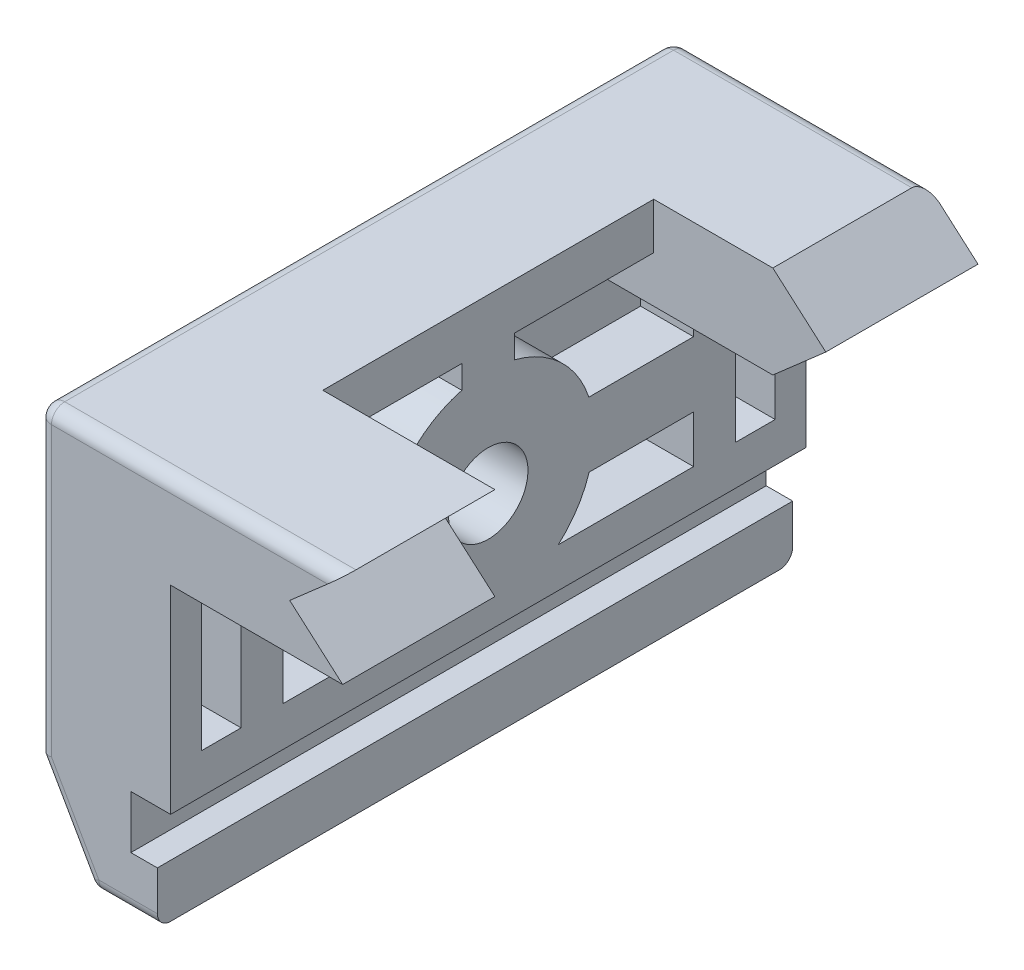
ISO-10303-21;
HEADER;
FILE_DESCRIPTION(('STEP AP214'),'2;1');
FILE_NAME('part.step','',(''),(''),'','','');
FILE_SCHEMA(('AUTOMOTIVE_DESIGN { 1 0 10303 214 1 1 1 1 }'));
ENDSEC;
DATA;
#1=APPLICATION_CONTEXT('core data for automotive mechanical design processes');
#2=APPLICATION_PROTOCOL_DEFINITION('international standard','automotive_design',2000,#1);
#3=PRODUCT_CONTEXT('',#1,'mechanical');
#4=PRODUCT('Part','Part','',(#3));
#5=PRODUCT_RELATED_PRODUCT_CATEGORY('part','',(#4));
#6=PRODUCT_DEFINITION_FORMATION('','',#4);
#7=PRODUCT_DEFINITION_CONTEXT('part definition',#1,'design');
#8=PRODUCT_DEFINITION('design','',#6,#7);
#9=PRODUCT_DEFINITION_SHAPE('','',#8);
#10=(LENGTH_UNIT() NAMED_UNIT(*) SI_UNIT(.MILLI.,.METRE.));
#11=(NAMED_UNIT(*) PLANE_ANGLE_UNIT() SI_UNIT($,.RADIAN.));
#12=(NAMED_UNIT(*) SI_UNIT($,.STERADIAN.) SOLID_ANGLE_UNIT());
#13=UNCERTAINTY_MEASURE_WITH_UNIT(LENGTH_MEASURE(1.E-05),#10,'distance_accuracy_value','');
#14=(GEOMETRIC_REPRESENTATION_CONTEXT(3) GLOBAL_UNCERTAINTY_ASSIGNED_CONTEXT((#13)) GLOBAL_UNIT_ASSIGNED_CONTEXT((#10,
#11,#12)) REPRESENTATION_CONTEXT('',''));
#15=CARTESIAN_POINT('',(0.,0.,0.));
#16=DIRECTION('',(0.,0.,1.));
#17=DIRECTION('',(1.,0.,0.));
#18=AXIS2_PLACEMENT_3D('',#15,#16,#17);
#19=CARTESIAN_POINT('',(-19.,0.,48.));
#20=DIRECTION('',(1.,0.,0.));
#21=DIRECTION('',(0.,1.,0.));
#22=AXIS2_PLACEMENT_3D('',#19,#20,#21);
#23=PLANE('',#22);
#24=DIRECTION('',(0.,-1.,0.));
#25=VECTOR('',#24,1.);
#26=CARTESIAN_POINT('',(-19.,0.,47.));
#27=LINE('',#26,#25);
#28=CARTESIAN_POINT('',(-19.,-23.,47.));
#29=VERTEX_POINT('',#28);
#30=CARTESIAN_POINT('',(-19.,-1.,47.));
#31=VERTEX_POINT('',#30);
#32=EDGE_CURVE('E826',#29,#31,#27,.F.);
#33=ORIENTED_EDGE('',*,*,#32,.T.);
#34=DIRECTION('',(0.,0.,-1.));
#35=VECTOR('',#34,1.);
#36=CARTESIAN_POINT('',(-19.,-1.,48.));
#37=LINE('',#36,#35);
#38=CARTESIAN_POINT('',(-19.,-1.,1.));
#39=VERTEX_POINT('',#38);
#40=EDGE_CURVE('E844',#31,#39,#37,.T.);
#41=ORIENTED_EDGE('',*,*,#40,.T.);
#42=DIRECTION('',(0.,-1.,0.));
#43=VECTOR('',#42,1.);
#44=CARTESIAN_POINT('',(-19.,0.,1.));
#45=LINE('',#44,#43);
#46=CARTESIAN_POINT('',(-19.,-23.,1.));
#47=VERTEX_POINT('',#46);
#48=EDGE_CURVE('E791',#39,#47,#45,.T.);
#49=ORIENTED_EDGE('',*,*,#48,.T.);
#50=DIRECTION('',(0.,0.,-1.));
#51=VECTOR('',#50,1.);
#52=CARTESIAN_POINT('',(-19.,-23.,48.));
#53=LINE('',#52,#51);
#54=EDGE_CURVE('E758',#29,#47,#53,.T.);
#55=ORIENTED_EDGE('',*,*,#54,.F.);
#56=EDGE_LOOP('',(#33,#41,#49,#55));
#57=FACE_BOUND('',#56,.T.);
#58=DIRECTION('',(0.,0.,1.));
#59=VECTOR('',#58,1.);
#60=CARTESIAN_POINT('',(-19.,-9.99999999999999,20.));
#61=LINE('',#60,#59);
#62=CARTESIAN_POINT('',(-19.,-9.99999999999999,20.));
#63=VERTEX_POINT('',#62);
#64=CARTESIAN_POINT('',(-19.,-10.,28.));
#65=VERTEX_POINT('',#64);
#66=EDGE_CURVE('E40',#63,#65,#61,.T.);
#67=ORIENTED_EDGE('',*,*,#66,.T.);
#68=CARTESIAN_POINT('',(-19.,-13.,28.));
#69=DIRECTION('',(-1.,0.,0.));
#70=DIRECTION('',(0.,-1.,0.));
#71=AXIS2_PLACEMENT_3D('',#68,#69,#70);
#72=CIRCLE('',#71,3.);
#73=CARTESIAN_POINT('',(-19.,-16.,28.));
#74=VERTEX_POINT('',#73);
#75=EDGE_CURVE('E384',#74,#65,#72,.T.);
#76=ORIENTED_EDGE('',*,*,#75,.F.);
#77=DIRECTION('',(0.,0.,-1.));
#78=VECTOR('',#77,1.);
#79=CARTESIAN_POINT('',(-19.,-16.,28.));
#80=LINE('',#79,#78);
#81=CARTESIAN_POINT('',(-19.,-16.,20.));
#82=VERTEX_POINT('',#81);
#83=EDGE_CURVE('E400',#74,#82,#80,.T.);
#84=ORIENTED_EDGE('',*,*,#83,.T.);
#85=CARTESIAN_POINT('',(-19.,-13.,20.));
#86=DIRECTION('',(-1.,0.,0.));
#87=DIRECTION('',(0.,-1.,0.));
#88=AXIS2_PLACEMENT_3D('',#85,#86,#87);
#89=CIRCLE('',#88,3.);
#90=EDGE_CURVE('E386',#63,#82,#89,.T.);
#91=ORIENTED_EDGE('',*,*,#90,.F.);
#92=EDGE_LOOP('',(#67,#76,#84,#91));
#93=FACE_BOUND('',#92,.T.);
#94=ADVANCED_FACE('F26',(#57,#93),#23,.F.);
#95=CARTESIAN_POINT('',(-24.,-13.,24.));
#96=DIRECTION('',(1.,0.,0.));
#97=DIRECTION('',(0.,1.,0.));
#98=AXIS2_PLACEMENT_3D('',#95,#96,#97);
#99=CYLINDRICAL_SURFACE('',#98,3.);
#100=CARTESIAN_POINT('',(-9.00000000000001,-13.,24.));
#101=DIRECTION('',(1.,0.,0.));
#102=DIRECTION('',(0.,1.,0.));
#103=AXIS2_PLACEMENT_3D('',#100,#101,#102);
#104=CIRCLE('',#103,3.);
#105=CARTESIAN_POINT('',(-9.00000000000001,-10.,24.));
#106=VERTEX_POINT('',#105);
#107=EDGE_CURVE('E642',#106,#106,#104,.T.);
#108=ORIENTED_EDGE('',*,*,#107,.T.);
#109=EDGE_LOOP('',(#108));
#110=FACE_BOUND('',#109,.T.);
#111=CARTESIAN_POINT('',(-14.,-13.,24.));
#112=DIRECTION('',(-1.,0.,0.));
#113=DIRECTION('',(0.,-1.,0.));
#114=AXIS2_PLACEMENT_3D('',#111,#112,#113);
#115=CIRCLE('',#114,3.);
#116=CARTESIAN_POINT('',(-14.,-16.,24.));
#117=VERTEX_POINT('',#116);
#118=CARTESIAN_POINT('',(-14.,-10.,24.));
#119=VERTEX_POINT('',#118);
#120=EDGE_CURVE('E11',#117,#119,#115,.F.);
#121=ORIENTED_EDGE('',*,*,#120,.F.);
#122=EDGE_CURVE('E29',#119,#117,#115,.F.);
#123=ORIENTED_EDGE('',*,*,#122,.F.);
#124=EDGE_LOOP('',(#121,#123));
#125=FACE_BOUND('',#124,.T.);
#126=ADVANCED_FACE('F862',(#110,#125),#99,.F.);
#127=CARTESIAN_POINT('',(-13.,-15.4199876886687,39.5082742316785));
#128=DIRECTION('',(0.,-1.,0.));
#129=DIRECTION('',(0.,0.,-1.));
#130=AXIS2_PLACEMENT_3D('',#127,#128,#129);
#131=PLANE('',#130);
#132=DIRECTION('',(1.,0.,0.));
#133=VECTOR('',#132,1.);
#134=CARTESIAN_POINT('',(-13.,-15.4199876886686,31.6251989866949));
#135=LINE('',#134,#133);
#136=CARTESIAN_POINT('',(-13.,-15.4199876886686,31.6251989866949));
#137=VERTEX_POINT('',#136);
#138=CARTESIAN_POINT('',(-9.00000000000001,-15.4199876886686,31.6251989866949));
#139=VERTEX_POINT('',#138);
#140=EDGE_CURVE('E483',#137,#139,#135,.T.);
#141=ORIENTED_EDGE('',*,*,#140,.T.);
#142=DIRECTION('',(0.,0.,-1.));
#143=VECTOR('',#142,1.);
#144=CARTESIAN_POINT('',(-9.00000000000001,-15.4199876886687,39.5082742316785));
#145=LINE('',#144,#143);
#146=CARTESIAN_POINT('',(-9.00000000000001,-15.4199876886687,39.5082742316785));
#147=VERTEX_POINT('',#146);
#148=EDGE_CURVE('E452',#147,#139,#145,.T.);
#149=ORIENTED_EDGE('',*,*,#148,.F.);
#150=DIRECTION('',(1.,0.,0.));
#151=VECTOR('',#150,1.);
#152=CARTESIAN_POINT('',(-13.,-15.4199876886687,39.5082742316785));
#153=LINE('',#152,#151);
#154=CARTESIAN_POINT('',(-13.,-15.4199876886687,39.5082742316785));
#155=VERTEX_POINT('',#154);
#156=EDGE_CURVE('E476',#155,#147,#153,.T.);
#157=ORIENTED_EDGE('',*,*,#156,.F.);
#158=DIRECTION('',(0.,0.,-1.));
#159=VECTOR('',#158,1.);
#160=CARTESIAN_POINT('',(-13.,-15.4199876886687,39.5082742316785));
#161=LINE('',#160,#159);
#162=EDGE_CURVE('E464',#155,#137,#161,.T.);
#163=ORIENTED_EDGE('',*,*,#162,.T.);
#164=EDGE_LOOP('',(#141,#149,#157,#163));
#165=FACE_BOUND('',#164,.T.);
#166=ADVANCED_FACE('F864',(#165),#131,.T.);
#167=CARTESIAN_POINT('',(-13.,-13.,24.));
#168=DIRECTION('',(1.,0.,0.));
#169=DIRECTION('',(0.,1.,0.));
#170=AXIS2_PLACEMENT_3D('',#167,#168,#169);
#171=CYLINDRICAL_SURFACE('',#170,8.);
#172=DIRECTION('',(1.,0.,0.));
#173=VECTOR('',#172,1.);
#174=CARTESIAN_POINT('',(-13.,-19.,29.2915026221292));
#175=LINE('',#174,#173);
#176=CARTESIAN_POINT('',(-13.,-19.,29.2915026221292));
#177=VERTEX_POINT('',#176);
#178=CARTESIAN_POINT('',(-9.00000000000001,-19.,29.2915026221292));
#179=VERTEX_POINT('',#178);
#180=EDGE_CURVE('E481',#177,#179,#175,.T.);
#181=ORIENTED_EDGE('',*,*,#180,.T.);
#182=CARTESIAN_POINT('',(-9.00000000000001,-13.,24.));
#183=DIRECTION('',(1.,0.,0.));
#184=DIRECTION('',(0.,1.,0.));
#185=AXIS2_PLACEMENT_3D('',#182,#183,#184);
#186=CIRCLE('',#185,8.);
#187=EDGE_CURVE('E455',#139,#179,#186,.T.);
#188=ORIENTED_EDGE('',*,*,#187,.F.);
#189=ORIENTED_EDGE('',*,*,#140,.F.);
#190=CARTESIAN_POINT('',(-13.,-13.,24.));
#191=DIRECTION('',(1.,0.,0.));
#192=DIRECTION('',(0.,1.,0.));
#193=AXIS2_PLACEMENT_3D('',#190,#191,#192);
#194=CIRCLE('',#193,8.);
#195=EDGE_CURVE('E467',#137,#177,#194,.T.);
#196=ORIENTED_EDGE('',*,*,#195,.T.);
#197=EDGE_LOOP('',(#181,#188,#189,#196));
#198=FACE_BOUND('',#197,.T.);
#199=ADVANCED_FACE('F871',(#198),#171,.T.);
#200=CARTESIAN_POINT('',(-13.,-19.,39.5082742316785));
#201=DIRECTION('',(0.,-1.,0.));
#202=DIRECTION('',(1.,0.,0.));
#203=AXIS2_PLACEMENT_3D('',#200,#201,#202);
#204=PLANE('',#203);
#205=DIRECTION('',(1.,0.,0.));
#206=VECTOR('',#205,1.);
#207=CARTESIAN_POINT('',(-13.,-19.,39.5082742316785));
#208=LINE('',#207,#206);
#209=CARTESIAN_POINT('',(-13.,-19.,39.5082742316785));
#210=VERTEX_POINT('',#209);
#211=CARTESIAN_POINT('',(-9.00000000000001,-19.,39.5082742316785));
#212=VERTEX_POINT('',#211);
#213=EDGE_CURVE('E479',#210,#212,#208,.T.);
#214=ORIENTED_EDGE('',*,*,#213,.T.);
#215=DIRECTION('',(0.,0.,-1.));
#216=VECTOR('',#215,1.);
#217=CARTESIAN_POINT('',(-9.00000000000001,-19.,39.5082742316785));
#218=LINE('',#217,#216);
#219=EDGE_CURVE('E458',#212,#179,#218,.T.);
#220=ORIENTED_EDGE('',*,*,#219,.T.);
#221=ORIENTED_EDGE('',*,*,#180,.F.);
#222=DIRECTION('',(0.,0.,-1.));
#223=VECTOR('',#222,1.);
#224=CARTESIAN_POINT('',(-13.,-19.,39.5082742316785));
#225=LINE('',#224,#223);
#226=EDGE_CURVE('E470',#210,#177,#225,.T.);
#227=ORIENTED_EDGE('',*,*,#226,.F.);
#228=EDGE_LOOP('',(#214,#220,#221,#227));
#229=FACE_BOUND('',#228,.T.);
#230=ADVANCED_FACE('F1339',(#229),#204,.F.);
#231=CARTESIAN_POINT('',(-13.,-15.4199876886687,39.5082742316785));
#232=DIRECTION('',(0.,0.,1.));
#233=DIRECTION('',(0.,-1.,0.));
#234=AXIS2_PLACEMENT_3D('',#231,#232,#233);
#235=PLANE('',#234);
#236=DIRECTION('',(0.,-1.,0.));
#237=VECTOR('',#236,1.);
#238=CARTESIAN_POINT('',(-13.,-15.4199876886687,39.5082742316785));
#239=LINE('',#238,#237);
#240=EDGE_CURVE('E473',#155,#210,#239,.T.);
#241=ORIENTED_EDGE('',*,*,#240,.F.);
#242=ORIENTED_EDGE('',*,*,#156,.T.);
#243=DIRECTION('',(0.,-1.,0.));
#244=VECTOR('',#243,1.);
#245=CARTESIAN_POINT('',(-9.00000000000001,-15.4199876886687,39.5082742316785));
#246=LINE('',#245,#244);
#247=EDGE_CURVE('E461',#147,#212,#246,.T.);
#248=ORIENTED_EDGE('',*,*,#247,.T.);
#249=ORIENTED_EDGE('',*,*,#213,.F.);
#250=EDGE_LOOP('',(#241,#242,#248,#249));
#251=FACE_BOUND('',#250,.T.);
#252=ADVANCED_FACE('F983',(#251),#235,.F.);
#253=CARTESIAN_POINT('',(-13.,-13.,24.));
#254=DIRECTION('',(1.,0.,0.));
#255=DIRECTION('',(0.,1.,0.));
#256=AXIS2_PLACEMENT_3D('',#253,#254,#255);
#257=PLANE('',#256);
#258=ORIENTED_EDGE('',*,*,#162,.F.);
#259=ORIENTED_EDGE('',*,*,#240,.T.);
#260=ORIENTED_EDGE('',*,*,#226,.T.);
#261=ORIENTED_EDGE('',*,*,#195,.F.);
#262=EDGE_LOOP('',(#258,#259,#260,#261));
#263=FACE_BOUND('',#262,.T.);
#264=ADVANCED_FACE('F981',(#263),#257,.T.);
#265=CARTESIAN_POINT('',(-9.00000000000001,-6.99999999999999,48.));
#266=DIRECTION('',(1.,0.,0.));
#267=DIRECTION('',(0.,1.,0.));
#268=AXIS2_PLACEMENT_3D('',#265,#266,#267);
#269=PLANE('',#268);
#270=DIRECTION('',(0.,0.,1.));
#271=VECTOR('',#270,1.);
#272=CARTESIAN_POINT('',(-9.00000000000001,-15.4199876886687,8.4917257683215));
#273=LINE('',#272,#271);
#274=CARTESIAN_POINT('',(-9.00000000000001,-15.4199876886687,8.4917257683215));
#275=VERTEX_POINT('',#274);
#276=CARTESIAN_POINT('',(-9.00000000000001,-15.4199876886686,16.3748010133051));
#277=VERTEX_POINT('',#276);
#278=EDGE_CURVE('E395',#275,#277,#273,.T.);
#279=ORIENTED_EDGE('',*,*,#278,.F.);
#280=DIRECTION('',(0.,-1.,0.));
#281=VECTOR('',#280,1.);
#282=CARTESIAN_POINT('',(-9.00000000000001,-15.4199876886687,8.4917257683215));
#283=LINE('',#282,#281);
#284=CARTESIAN_POINT('',(-9.00000000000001,-19.,8.49172576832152));
#285=VERTEX_POINT('',#284);
#286=EDGE_CURVE('E428',#275,#285,#283,.T.);
#287=ORIENTED_EDGE('',*,*,#286,.T.);
#288=DIRECTION('',(0.,0.,1.));
#289=VECTOR('',#288,1.);
#290=CARTESIAN_POINT('',(-9.00000000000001,-19.,8.49172576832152));
#291=LINE('',#290,#289);
#292=CARTESIAN_POINT('',(-9.00000000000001,-19.,18.7084973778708));
#293=VERTEX_POINT('',#292);
#294=EDGE_CURVE('E425',#285,#293,#291,.T.);
#295=ORIENTED_EDGE('',*,*,#294,.T.);
#296=CARTESIAN_POINT('',(-9.00000000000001,-13.,24.));
#297=DIRECTION('',(1.,0.,0.));
#298=DIRECTION('',(0.,1.,0.));
#299=AXIS2_PLACEMENT_3D('',#296,#297,#298);
#300=CIRCLE('',#299,8.);
#301=EDGE_CURVE('E422',#293,#277,#300,.T.);
#302=ORIENTED_EDGE('',*,*,#301,.T.);
#303=EDGE_LOOP('',(#279,#287,#295,#302));
#304=FACE_BOUND('',#303,.T.);
#305=ORIENTED_EDGE('',*,*,#107,.F.);
#306=EDGE_LOOP('',(#305));
#307=FACE_BOUND('',#306,.T.);
#308=DIRECTION('',(0.,0.,1.));
#309=VECTOR('',#308,1.);
#310=CARTESIAN_POINT('',(-9.00000000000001,-3.5,11.5));
#311=LINE('',#310,#309);
#312=CARTESIAN_POINT('',(-9.00000000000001,-3.5,11.5));
#313=VERTEX_POINT('',#312);
#314=CARTESIAN_POINT('',(-9.00000000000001,-3.49999999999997,22.0009614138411));
#315=VERTEX_POINT('',#314);
#316=EDGE_CURVE('E491',#313,#315,#311,.T.);
#317=ORIENTED_EDGE('',*,*,#316,.F.);
#318=DIRECTION('',(0.,-1.,0.));
#319=VECTOR('',#318,1.);
#320=CARTESIAN_POINT('',(-9.,41.,11.5));
#321=LINE('',#320,#319);
#322=CARTESIAN_POINT('',(-9.00000000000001,0.,11.5));
#323=VERTEX_POINT('',#322);
#324=EDGE_CURVE('E699',#323,#313,#321,.T.);
#325=ORIENTED_EDGE('',*,*,#324,.F.);
#326=DIRECTION('',(0.,0.,-1.));
#327=VECTOR('',#326,1.);
#328=CARTESIAN_POINT('',(-9.00000000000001,0.,48.));
#329=LINE('',#328,#327);
#330=CARTESIAN_POINT('',(-9.00000000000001,0.,36.5));
#331=VERTEX_POINT('',#330);
#332=EDGE_CURVE('E764',#331,#323,#329,.T.);
#333=ORIENTED_EDGE('',*,*,#332,.F.);
#334=DIRECTION('',(0.,-1.,0.));
#335=VECTOR('',#334,1.);
#336=CARTESIAN_POINT('',(-9.,41.,36.5));
#337=LINE('',#336,#335);
#338=CARTESIAN_POINT('',(-9.00000000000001,-3.5,36.5));
#339=VERTEX_POINT('',#338);
#340=EDGE_CURVE('E696',#331,#339,#337,.T.);
#341=ORIENTED_EDGE('',*,*,#340,.T.);
#342=DIRECTION('',(0.,0.,-1.));
#343=VECTOR('',#342,1.);
#344=CARTESIAN_POINT('',(-9.00000000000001,-3.5,36.5));
#345=LINE('',#344,#343);
#346=CARTESIAN_POINT('',(-9.00000000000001,-3.49999999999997,25.9990385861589));
#347=VERTEX_POINT('',#346);
#348=EDGE_CURVE('E576',#339,#347,#345,.T.);
#349=ORIENTED_EDGE('',*,*,#348,.T.);
#350=DIRECTION('',(0.,1.,0.));
#351=VECTOR('',#350,1.);
#352=CARTESIAN_POINT('',(-9.00000000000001,-5.25378513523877,25.9990385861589));
#353=LINE('',#352,#351);
#354=CARTESIAN_POINT('',(-9.00000000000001,-5.25378513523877,25.9990385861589));
#355=VERTEX_POINT('',#354);
#356=EDGE_CURVE('E573',#355,#347,#353,.T.);
#357=ORIENTED_EDGE('',*,*,#356,.F.);
#358=CARTESIAN_POINT('',(-9.00000000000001,-13.,24.));
#359=DIRECTION('',(1.,0.,0.));
#360=DIRECTION('',(0.,1.,0.));
#361=AXIS2_PLACEMENT_3D('',#358,#359,#360);
#362=CIRCLE('',#361,8.);
#363=CARTESIAN_POINT('',(-9.00000000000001,-10.5,31.5993420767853));
#364=VERTEX_POINT('',#363);
#365=EDGE_CURVE('E570',#355,#364,#362,.T.);
#366=ORIENTED_EDGE('',*,*,#365,.T.);
#367=DIRECTION('',(0.,0.,-1.));
#368=VECTOR('',#367,1.);
#369=CARTESIAN_POINT('',(-9.00000000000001,-10.5,39.5082742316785));
#370=LINE('',#369,#368);
#371=CARTESIAN_POINT('',(-9.00000000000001,-10.5,39.5082742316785));
#372=VERTEX_POINT('',#371);
#373=EDGE_CURVE('E567',#372,#364,#370,.T.);
#374=ORIENTED_EDGE('',*,*,#373,.F.);
#375=DIRECTION('',(0.,-1.,0.));
#376=VECTOR('',#375,1.);
#377=CARTESIAN_POINT('',(-9.00000000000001,-7.,39.5082742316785));
#378=LINE('',#377,#376);
#379=CARTESIAN_POINT('',(-9.00000000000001,-7.,39.5082742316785));
#380=VERTEX_POINT('',#379);
#381=EDGE_CURVE('E564',#380,#372,#378,.T.);
#382=ORIENTED_EDGE('',*,*,#381,.F.);
#383=DIRECTION('',(0.,0.,-1.));
#384=VECTOR('',#383,1.);
#385=CARTESIAN_POINT('',(-9.00000000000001,-6.99999999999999,48.));
#386=LINE('',#385,#384);
#387=CARTESIAN_POINT('',(-9.00000000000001,-6.99999999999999,42.6765287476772));
#388=VERTEX_POINT('',#387);
#389=EDGE_CURVE('E747',#388,#380,#386,.T.);
#390=ORIENTED_EDGE('',*,*,#389,.F.);
#391=DIRECTION('',(0.,-1.,0.));
#392=VECTOR('',#391,1.);
#393=CARTESIAN_POINT('',(-9.00000000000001,-6.99999999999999,42.6765287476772));
#394=LINE('',#393,#392);
#395=CARTESIAN_POINT('',(-9.00000000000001,-19.,42.6765287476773));
#396=VERTEX_POINT('',#395);
#397=EDGE_CURVE('E618',#388,#396,#394,.T.);
#398=ORIENTED_EDGE('',*,*,#397,.T.);
#399=DIRECTION('',(0.,0.,1.));
#400=VECTOR('',#399,1.);
#401=CARTESIAN_POINT('',(-9.00000000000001,-19.,42.6765287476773));
#402=LINE('',#401,#400);
#403=CARTESIAN_POINT('',(-9.00000000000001,-19.,45.6765287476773));
#404=VERTEX_POINT('',#403);
#405=EDGE_CURVE('E615',#396,#404,#402,.T.);
#406=ORIENTED_EDGE('',*,*,#405,.T.);
#407=DIRECTION('',(0.,-1.,0.));
#408=VECTOR('',#407,1.);
#409=CARTESIAN_POINT('',(-9.00000000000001,-7.,45.6765287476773));
#410=LINE('',#409,#408);
#411=CARTESIAN_POINT('',(-9.00000000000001,-7.,45.6765287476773));
#412=VERTEX_POINT('',#411);
#413=EDGE_CURVE('E612',#412,#404,#410,.T.);
#414=ORIENTED_EDGE('',*,*,#413,.F.);
#415=CARTESIAN_POINT('',(-9.00000000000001,-6.99999999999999,48.));
#416=VERTEX_POINT('',#415);
#417=EDGE_CURVE('E743',#416,#412,#386,.T.);
#418=ORIENTED_EDGE('',*,*,#417,.F.);
#419=DIRECTION('',(0.,-1.,0.));
#420=VECTOR('',#419,1.);
#421=CARTESIAN_POINT('',(-9.00000000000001,-6.99999999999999,48.));
#422=LINE('',#421,#420);
#423=CARTESIAN_POINT('',(-9.00000000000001,-22.,48.));
#424=VERTEX_POINT('',#423);
#425=EDGE_CURVE('E723',#416,#424,#422,.T.);
#426=ORIENTED_EDGE('',*,*,#425,.T.);
#427=DIRECTION('',(0.,0.,-1.));
#428=VECTOR('',#427,1.);
#429=CARTESIAN_POINT('',(-9.00000000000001,-22.,48.));
#430=LINE('',#429,#428);
#431=CARTESIAN_POINT('',(-9.00000000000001,-22.,0.));
#432=VERTEX_POINT('',#431);
#433=EDGE_CURVE('E746',#424,#432,#430,.T.);
#434=ORIENTED_EDGE('',*,*,#433,.T.);
#435=DIRECTION('',(0.,-1.,0.));
#436=VECTOR('',#435,1.);
#437=CARTESIAN_POINT('',(-9.00000000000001,-6.99999999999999,0.));
#438=LINE('',#437,#436);
#439=CARTESIAN_POINT('',(-9.00000000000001,-6.99999999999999,0.));
#440=VERTEX_POINT('',#439);
#441=EDGE_CURVE('E705',#440,#432,#438,.T.);
#442=ORIENTED_EDGE('',*,*,#441,.F.);
#443=CARTESIAN_POINT('',(-9.00000000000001,-6.99999999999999,2.32347125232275));
#444=VERTEX_POINT('',#443);
#445=EDGE_CURVE('E742',#444,#440,#386,.T.);
#446=ORIENTED_EDGE('',*,*,#445,.F.);
#447=DIRECTION('',(0.,-1.,0.));
#448=VECTOR('',#447,1.);
#449=CARTESIAN_POINT('',(-9.00000000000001,-7.,2.32347125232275));
#450=LINE('',#449,#448);
#451=CARTESIAN_POINT('',(-9.00000000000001,-19.,2.32347125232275));
#452=VERTEX_POINT('',#451);
#453=EDGE_CURVE('E533',#444,#452,#450,.T.);
#454=ORIENTED_EDGE('',*,*,#453,.T.);
#455=DIRECTION('',(0.,0.,-1.));
#456=VECTOR('',#455,1.);
#457=CARTESIAN_POINT('',(-9.00000000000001,-19.,5.32347125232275));
#458=LINE('',#457,#456);
#459=CARTESIAN_POINT('',(-9.00000000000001,-19.,5.32347125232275));
#460=VERTEX_POINT('',#459);
#461=EDGE_CURVE('E536',#460,#452,#458,.T.);
#462=ORIENTED_EDGE('',*,*,#461,.F.);
#463=DIRECTION('',(0.,-1.,0.));
#464=VECTOR('',#463,1.);
#465=CARTESIAN_POINT('',(-9.00000000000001,-6.99999999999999,5.32347125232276));
#466=LINE('',#465,#464);
#467=CARTESIAN_POINT('',(-9.00000000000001,-6.99999999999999,5.32347125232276));
#468=VERTEX_POINT('',#467);
#469=EDGE_CURVE('E539',#468,#460,#466,.T.);
#470=ORIENTED_EDGE('',*,*,#469,.F.);
#471=CARTESIAN_POINT('',(-9.00000000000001,-7.,8.49172576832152));
#472=VERTEX_POINT('',#471);
#473=EDGE_CURVE('E748',#472,#468,#386,.T.);
#474=ORIENTED_EDGE('',*,*,#473,.F.);
#475=DIRECTION('',(0.,-1.,0.));
#476=VECTOR('',#475,1.);
#477=CARTESIAN_POINT('',(-9.00000000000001,-7.,8.49172576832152));
#478=LINE('',#477,#476);
#479=CARTESIAN_POINT('',(-9.00000000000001,-10.5,8.4917257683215));
#480=VERTEX_POINT('',#479);
#481=EDGE_CURVE('E494',#472,#480,#478,.T.);
#482=ORIENTED_EDGE('',*,*,#481,.T.);
#483=DIRECTION('',(0.,0.,1.));
#484=VECTOR('',#483,1.);
#485=CARTESIAN_POINT('',(-9.00000000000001,-10.5,8.4917257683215));
#486=LINE('',#485,#484);
#487=CARTESIAN_POINT('',(-9.00000000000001,-10.5,16.4006579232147));
#488=VERTEX_POINT('',#487);
#489=EDGE_CURVE('E497',#480,#488,#486,.T.);
#490=ORIENTED_EDGE('',*,*,#489,.T.);
#491=CARTESIAN_POINT('',(-9.00000000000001,-13.,24.));
#492=DIRECTION('',(1.,0.,0.));
#493=DIRECTION('',(0.,1.,0.));
#494=AXIS2_PLACEMENT_3D('',#491,#492,#493);
#495=CIRCLE('',#494,8.);
#496=CARTESIAN_POINT('',(-9.00000000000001,-5.25378513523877,22.0009614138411));
#497=VERTEX_POINT('',#496);
#498=EDGE_CURVE('E485',#488,#497,#495,.T.);
#499=ORIENTED_EDGE('',*,*,#498,.T.);
#500=DIRECTION('',(0.,1.,0.));
#501=VECTOR('',#500,1.);
#502=CARTESIAN_POINT('',(-9.00000000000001,-5.25378513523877,22.0009614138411));
#503=LINE('',#502,#501);
#504=EDGE_CURVE('E488',#497,#315,#503,.T.);
#505=ORIENTED_EDGE('',*,*,#504,.T.);
#506=EDGE_LOOP('',(#317,#325,#333,#341,#349,#357,#366,#374,#382,#390,#398,#406,#414,#418,#426,
#434,#442,#446,#454,#462,#470,#474,#482,#490,#499,#505));
#507=FACE_BOUND('',#506,.T.);
#508=ORIENTED_EDGE('',*,*,#247,.F.);
#509=ORIENTED_EDGE('',*,*,#148,.T.);
#510=ORIENTED_EDGE('',*,*,#187,.T.);
#511=ORIENTED_EDGE('',*,*,#219,.F.);
#512=EDGE_LOOP('',(#508,#509,#510,#511));
#513=FACE_BOUND('',#512,.T.);
#514=ADVANCED_FACE('F978',(#304,#307,#507,#513),#269,.T.);
#515=CARTESIAN_POINT('',(3.99999999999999,-7.,48.));
#516=DIRECTION('',(0.,-1.,0.));
#517=DIRECTION('',(1.,0.,0.));
#518=AXIS2_PLACEMENT_3D('',#515,#516,#517);
#519=PLANE('',#518);
#520=DIRECTION('',(-1.,0.,0.));
#521=VECTOR('',#520,1.);
#522=CARTESIAN_POINT('',(3.99999999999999,-7.,0.));
#523=LINE('',#522,#521);
#524=CARTESIAN_POINT('',(0.,-7.,0.));
#525=VERTEX_POINT('',#524);
#526=EDGE_CURVE('E702',#525,#440,#523,.T.);
#527=ORIENTED_EDGE('',*,*,#526,.F.);
#528=DIRECTION('',(0.,0.,-1.));
#529=VECTOR('',#528,1.);
#530=CARTESIAN_POINT('',(0.,-7.,15.));
#531=LINE('',#530,#529);
#532=CARTESIAN_POINT('',(0.,-7.,11.5));
#533=VERTEX_POINT('',#532);
#534=EDGE_CURVE('E670',#533,#525,#531,.T.);
#535=ORIENTED_EDGE('',*,*,#534,.F.);
#536=DIRECTION('',(1.,0.,0.));
#537=VECTOR('',#536,1.);
#538=CARTESIAN_POINT('',(-9.00000000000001,-6.99999999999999,11.5));
#539=LINE('',#538,#537);
#540=CARTESIAN_POINT('',(-13.,-6.99999999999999,11.5));
#541=VERTEX_POINT('',#540);
#542=EDGE_CURVE('E691',#541,#533,#539,.T.);
#543=ORIENTED_EDGE('',*,*,#542,.F.);
#544=DIRECTION('',(0.,0.,-1.));
#545=VECTOR('',#544,1.);
#546=CARTESIAN_POINT('',(-13.,-6.99999999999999,11.5));
#547=LINE('',#546,#545);
#548=CARTESIAN_POINT('',(-13.,-6.99999999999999,8.49172576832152));
#549=VERTEX_POINT('',#548);
#550=EDGE_CURVE('E512',#541,#549,#547,.T.);
#551=ORIENTED_EDGE('',*,*,#550,.T.);
#552=DIRECTION('',(1.,0.,0.));
#553=VECTOR('',#552,1.);
#554=CARTESIAN_POINT('',(-13.,-6.99999999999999,8.49172576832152));
#555=LINE('',#554,#553);
#556=EDGE_CURVE('E525',#549,#472,#555,.T.);
#557=ORIENTED_EDGE('',*,*,#556,.T.);
#558=ORIENTED_EDGE('',*,*,#473,.T.);
#559=DIRECTION('',(1.,0.,0.));
#560=VECTOR('',#559,1.);
#561=CARTESIAN_POINT('',(-13.,-6.99999999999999,5.32347125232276));
#562=LINE('',#561,#560);
#563=CARTESIAN_POINT('',(-13.,-6.99999999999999,5.32347125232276));
#564=VERTEX_POINT('',#563);
#565=EDGE_CURVE('E557',#564,#468,#562,.T.);
#566=ORIENTED_EDGE('',*,*,#565,.F.);
#567=DIRECTION('',(0.,0.,1.));
#568=VECTOR('',#567,1.);
#569=CARTESIAN_POINT('',(-13.,-6.99999999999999,2.32347125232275));
#570=LINE('',#569,#568);
#571=CARTESIAN_POINT('',(-13.,-6.99999999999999,2.32347125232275));
#572=VERTEX_POINT('',#571);
#573=EDGE_CURVE('E551',#572,#564,#570,.T.);
#574=ORIENTED_EDGE('',*,*,#573,.F.);
#575=DIRECTION('',(1.,0.,0.));
#576=VECTOR('',#575,1.);
#577=CARTESIAN_POINT('',(-13.,-6.99999999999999,2.32347125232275));
#578=LINE('',#577,#576);
#579=EDGE_CURVE('E554',#572,#444,#578,.T.);
#580=ORIENTED_EDGE('',*,*,#579,.T.);
#581=ORIENTED_EDGE('',*,*,#445,.T.);
#582=EDGE_LOOP('',(#527,#535,#543,#551,#557,#558,#566,#574,#580,#581));
#583=FACE_BOUND('',#582,.T.);
#584=ADVANCED_FACE('F966',(#583),#519,.T.);
#585=CARTESIAN_POINT('',(-12.,0.,0.));
#586=DIRECTION('',(0.,0.,-1.));
#587=DIRECTION('',(-1.,0.,0.));
#588=AXIS2_PLACEMENT_3D('',#585,#586,#587);
#589=PLANE('',#588);
#590=DIRECTION('',(0.,-1.,0.));
#591=VECTOR('',#590,1.);
#592=CARTESIAN_POINT('',(-10.,-26.,0.));
#593=LINE('',#592,#591);
#594=CARTESIAN_POINT('',(-10.,-26.,0.));
#595=VERTEX_POINT('',#594);
#596=CARTESIAN_POINT('',(-10.,-29.,0.));
#597=VERTEX_POINT('',#596);
#598=EDGE_CURVE('E717',#595,#597,#593,.T.);
#599=ORIENTED_EDGE('',*,*,#598,.T.);
#600=DIRECTION('',(-1.,0.,0.));
#601=VECTOR('',#600,1.);
#602=CARTESIAN_POINT('',(-12.,-29.,0.));
#603=LINE('',#602,#601);
#604=CARTESIAN_POINT('',(-14.4196774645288,-29.,0.));
#605=VERTEX_POINT('',#604);
#606=EDGE_CURVE('E806',#597,#605,#603,.T.);
#607=ORIENTED_EDGE('',*,*,#606,.T.);
#608=DIRECTION('',(0.496138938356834,-0.868243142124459,0.));
#609=VECTOR('',#608,1.);
#610=CARTESIAN_POINT('',(-18.1317568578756,-22.5038610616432,0.));
#611=LINE('',#610,#609);
#612=CARTESIAN_POINT('',(-18.,-22.7344355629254,0.));
#613=VERTEX_POINT('',#612);
#614=EDGE_CURVE('E778',#605,#613,#611,.F.);
#615=ORIENTED_EDGE('',*,*,#614,.T.);
#616=DIRECTION('',(0.,-1.,0.));
#617=VECTOR('',#616,1.);
#618=CARTESIAN_POINT('',(-18.,0.,0.));
#619=LINE('',#618,#617);
#620=CARTESIAN_POINT('',(-18.,-1.,0.));
#621=VERTEX_POINT('',#620);
#622=EDGE_CURVE('E780',#613,#621,#619,.F.);
#623=ORIENTED_EDGE('',*,*,#622,.T.);
#624=DIRECTION('',(1.,0.,0.));
#625=VECTOR('',#624,1.);
#626=CARTESIAN_POINT('',(-12.,-1.,0.));
#627=LINE('',#626,#625);
#628=CARTESIAN_POINT('',(1.14285714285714,-1.,0.));
#629=VERTEX_POINT('',#628);
#630=EDGE_CURVE('E783',#621,#629,#627,.T.);
#631=ORIENTED_EDGE('',*,*,#630,.T.);
#632=DIRECTION('',(-0.752576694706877,0.658504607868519,0.));
#633=VECTOR('',#632,1.);
#634=CARTESIAN_POINT('',(3.99999999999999,-3.5,0.));
#635=LINE('',#634,#633);
#636=CARTESIAN_POINT('',(3.99999999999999,-3.5,0.));
#637=VERTEX_POINT('',#636);
#638=EDGE_CURVE('E674',#637,#629,#635,.T.);
#639=ORIENTED_EDGE('',*,*,#638,.F.);
#640=DIRECTION('',(-0.752576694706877,-0.658504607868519,0.));
#641=VECTOR('',#640,1.);
#642=CARTESIAN_POINT('',(3.99999999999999,-3.5,0.));
#643=LINE('',#642,#641);
#644=EDGE_CURVE('E667',#637,#525,#643,.T.);
#645=ORIENTED_EDGE('',*,*,#644,.T.);
#646=ORIENTED_EDGE('',*,*,#526,.T.);
#647=ORIENTED_EDGE('',*,*,#441,.T.);
#648=DIRECTION('',(-1.,0.,0.));
#649=VECTOR('',#648,1.);
#650=CARTESIAN_POINT('',(-9.00000000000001,-22.,0.));
#651=LINE('',#650,#649);
#652=CARTESIAN_POINT('',(-12.,-22.,0.));
#653=VERTEX_POINT('',#652);
#654=EDGE_CURVE('E708',#432,#653,#651,.T.);
#655=ORIENTED_EDGE('',*,*,#654,.T.);
#656=DIRECTION('',(0.,-1.,0.));
#657=VECTOR('',#656,1.);
#658=CARTESIAN_POINT('',(-12.,-22.,0.));
#659=LINE('',#658,#657);
#660=CARTESIAN_POINT('',(-12.,-26.,0.));
#661=VERTEX_POINT('',#660);
#662=EDGE_CURVE('E711',#653,#661,#659,.T.);
#663=ORIENTED_EDGE('',*,*,#662,.T.);
#664=DIRECTION('',(1.,0.,0.));
#665=VECTOR('',#664,1.);
#666=CARTESIAN_POINT('',(-12.,-26.,0.));
#667=LINE('',#666,#665);
#668=EDGE_CURVE('E714',#661,#595,#667,.T.);
#669=ORIENTED_EDGE('',*,*,#668,.T.);
#670=EDGE_LOOP('',(#599,#607,#615,#623,#631,#639,#645,#646,#647,#655,#663,#669));
#671=FACE_BOUND('',#670,.T.);
#672=ADVANCED_FACE('F962',(#671),#589,.T.);
#673=CARTESIAN_POINT('',(-9.,41.,11.5));
#674=DIRECTION('',(0.,0.,-1.));
#675=DIRECTION('',(-1.,0.,0.));
#676=AXIS2_PLACEMENT_3D('',#673,#674,#675);
#677=PLANE('',#676);
#678=DIRECTION('',(-0.752576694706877,-0.658504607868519,0.));
#679=VECTOR('',#678,1.);
#680=CARTESIAN_POINT('',(18.6902654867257,9.35398230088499,11.5));
#681=LINE('',#680,#679);
#682=CARTESIAN_POINT('',(3.99999999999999,-3.5,11.5));
#683=VERTEX_POINT('',#682);
#684=EDGE_CURVE('E672',#683,#533,#681,.T.);
#685=ORIENTED_EDGE('',*,*,#684,.F.);
#686=DIRECTION('',(-0.752576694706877,0.658504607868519,0.));
#687=VECTOR('',#686,1.);
#688=CARTESIAN_POINT('',(-25.4159292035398,22.2389380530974,11.5));
#689=LINE('',#688,#687);
#690=CARTESIAN_POINT('',(0.,0.,11.5));
#691=VERTEX_POINT('',#690);
#692=EDGE_CURVE('E775',#683,#691,#689,.T.);
#693=ORIENTED_EDGE('',*,*,#692,.T.);
#694=DIRECTION('',(-1.,0.,0.));
#695=VECTOR('',#694,1.);
#696=CARTESIAN_POINT('',(0.,0.,11.5));
#697=LINE('',#696,#695);
#698=EDGE_CURVE('E767',#691,#323,#697,.T.);
#699=ORIENTED_EDGE('',*,*,#698,.T.);
#700=ORIENTED_EDGE('',*,*,#324,.T.);
#701=DIRECTION('',(1.,0.,0.));
#702=VECTOR('',#701,1.);
#703=CARTESIAN_POINT('',(-13.,-3.5,11.5));
#704=LINE('',#703,#702);
#705=CARTESIAN_POINT('',(-13.,-3.5,11.5));
#706=VERTEX_POINT('',#705);
#707=EDGE_CURVE('E527',#706,#313,#704,.T.);
#708=ORIENTED_EDGE('',*,*,#707,.F.);
#709=DIRECTION('',(0.,-1.,0.));
#710=VECTOR('',#709,1.);
#711=CARTESIAN_POINT('',(-13.,-3.5,11.5));
#712=LINE('',#711,#710);
#713=EDGE_CURVE('E509',#706,#541,#712,.T.);
#714=ORIENTED_EDGE('',*,*,#713,.T.);
#715=ORIENTED_EDGE('',*,*,#542,.T.);
#716=EDGE_LOOP('',(#685,#693,#699,#700,#708,#714,#715));
#717=FACE_BOUND('',#716,.T.);
#718=ADVANCED_FACE('F959',(#717),#677,.F.);
#719=CARTESIAN_POINT('',(-12.,0.,48.));
#720=DIRECTION('',(0.,0.,-1.));
#721=DIRECTION('',(-1.,0.,0.));
#722=AXIS2_PLACEMENT_3D('',#719,#720,#721);
#723=PLANE('',#722);
#724=DIRECTION('',(0.752576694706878,0.658504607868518,0.));
#725=VECTOR('',#724,1.);
#726=CARTESIAN_POINT('',(0.,-3.5,48.));
#727=LINE('',#726,#725);
#728=CARTESIAN_POINT('',(0.,-3.5,48.));
#729=VERTEX_POINT('',#728);
#730=CARTESIAN_POINT('',(2.85714285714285,-1.,48.));
#731=VERTEX_POINT('',#730);
#732=EDGE_CURVE('E686',#729,#731,#727,.T.);
#733=ORIENTED_EDGE('',*,*,#732,.T.);
#734=DIRECTION('',(1.,0.,0.));
#735=VECTOR('',#734,1.);
#736=CARTESIAN_POINT('',(0.,-1.,48.));
#737=LINE('',#736,#735);
#738=CARTESIAN_POINT('',(-18.,-1.,48.));
#739=VERTEX_POINT('',#738);
#740=EDGE_CURVE('E823',#731,#739,#737,.F.);
#741=ORIENTED_EDGE('',*,*,#740,.T.);
#742=DIRECTION('',(0.,-1.,0.));
#743=VECTOR('',#742,1.);
#744=CARTESIAN_POINT('',(-18.,0.,48.));
#745=LINE('',#744,#743);
#746=CARTESIAN_POINT('',(-18.,-22.7344355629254,48.));
#747=VERTEX_POINT('',#746);
#748=EDGE_CURVE('E821',#739,#747,#745,.T.);
#749=ORIENTED_EDGE('',*,*,#748,.T.);
#750=DIRECTION('',(0.496138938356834,-0.868243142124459,0.));
#751=VECTOR('',#750,1.);
#752=CARTESIAN_POINT('',(-26.3163722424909,-8.18078413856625,48.));
#753=LINE('',#752,#751);
#754=CARTESIAN_POINT('',(-14.4196774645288,-29.,48.));
#755=VERTEX_POINT('',#754);
#756=EDGE_CURVE('E819',#747,#755,#753,.T.);
#757=ORIENTED_EDGE('',*,*,#756,.T.);
#758=DIRECTION('',(-1.,0.,0.));
#759=VECTOR('',#758,1.);
#760=CARTESIAN_POINT('',(-10.,-29.,48.));
#761=LINE('',#760,#759);
#762=CARTESIAN_POINT('',(-10.,-29.,48.));
#763=VERTEX_POINT('',#762);
#764=EDGE_CURVE('E817',#755,#763,#761,.F.);
#765=ORIENTED_EDGE('',*,*,#764,.T.);
#766=DIRECTION('',(0.,-1.,0.));
#767=VECTOR('',#766,1.);
#768=CARTESIAN_POINT('',(-10.,-26.,48.));
#769=LINE('',#768,#767);
#770=CARTESIAN_POINT('',(-10.,-26.,48.));
#771=VERTEX_POINT('',#770);
#772=EDGE_CURVE('E735',#771,#763,#769,.T.);
#773=ORIENTED_EDGE('',*,*,#772,.F.);
#774=DIRECTION('',(1.,0.,0.));
#775=VECTOR('',#774,1.);
#776=CARTESIAN_POINT('',(-12.,-26.,48.));
#777=LINE('',#776,#775);
#778=CARTESIAN_POINT('',(-12.,-26.,48.));
#779=VERTEX_POINT('',#778);
#780=EDGE_CURVE('E732',#779,#771,#777,.T.);
#781=ORIENTED_EDGE('',*,*,#780,.F.);
#782=DIRECTION('',(0.,-1.,0.));
#783=VECTOR('',#782,1.);
#784=CARTESIAN_POINT('',(-12.,-22.,48.));
#785=LINE('',#784,#783);
#786=CARTESIAN_POINT('',(-12.,-22.,48.));
#787=VERTEX_POINT('',#786);
#788=EDGE_CURVE('E729',#787,#779,#785,.T.);
#789=ORIENTED_EDGE('',*,*,#788,.F.);
#790=DIRECTION('',(-1.,0.,0.));
#791=VECTOR('',#790,1.);
#792=CARTESIAN_POINT('',(-9.00000000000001,-22.,48.));
#793=LINE('',#792,#791);
#794=EDGE_CURVE('E726',#424,#787,#793,.T.);
#795=ORIENTED_EDGE('',*,*,#794,.F.);
#796=ORIENTED_EDGE('',*,*,#425,.F.);
#797=DIRECTION('',(-1.,0.,0.));
#798=VECTOR('',#797,1.);
#799=CARTESIAN_POINT('',(3.99999999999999,-7.,48.));
#800=LINE('',#799,#798);
#801=CARTESIAN_POINT('',(3.99999999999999,-7.,48.));
#802=VERTEX_POINT('',#801);
#803=EDGE_CURVE('E720',#802,#416,#800,.T.);
#804=ORIENTED_EDGE('',*,*,#803,.F.);
#805=DIRECTION('',(-0.752576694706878,0.658504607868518,0.));
#806=VECTOR('',#805,1.);
#807=CARTESIAN_POINT('',(3.99999999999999,-7.,48.));
#808=LINE('',#807,#806);
#809=EDGE_CURVE('E683',#802,#729,#808,.T.);
#810=ORIENTED_EDGE('',*,*,#809,.T.);
#811=EDGE_LOOP('',(#733,#741,#749,#757,#765,#773,#781,#789,#795,#796,#804,#810));
#812=FACE_BOUND('',#811,.T.);
#813=ADVANCED_FACE('F957',(#812),#723,.F.);
#814=CARTESIAN_POINT('',(4.,41.,36.5));
#815=DIRECTION('',(0.,0.,1.));
#816=DIRECTION('',(1.,0.,0.));
#817=AXIS2_PLACEMENT_3D('',#814,#815,#816);
#818=PLANE('',#817);
#819=DIRECTION('',(-0.752576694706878,0.658504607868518,0.));
#820=VECTOR('',#819,1.);
#821=CARTESIAN_POINT('',(-19.787610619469,13.8141592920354,36.5));
#822=LINE('',#821,#820);
#823=CARTESIAN_POINT('',(3.99999999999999,-7.,36.5));
#824=VERTEX_POINT('',#823);
#825=CARTESIAN_POINT('',(0.,-3.5,36.5));
#826=VERTEX_POINT('',#825);
#827=EDGE_CURVE('E772',#824,#826,#822,.T.);
#828=ORIENTED_EDGE('',*,*,#827,.F.);
#829=DIRECTION('',(-1.,0.,0.));
#830=VECTOR('',#829,1.);
#831=CARTESIAN_POINT('',(3.99999999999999,-7.,36.5));
#832=LINE('',#831,#830);
#833=CARTESIAN_POINT('',(-13.,-6.99999999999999,36.5));
#834=VERTEX_POINT('',#833);
#835=EDGE_CURVE('E694',#824,#834,#832,.T.);
#836=ORIENTED_EDGE('',*,*,#835,.T.);
#837=DIRECTION('',(0.,-1.,0.));
#838=VECTOR('',#837,1.);
#839=CARTESIAN_POINT('',(-13.,-3.5,36.5));
#840=LINE('',#839,#838);
#841=CARTESIAN_POINT('',(-13.,-3.5,36.5));
#842=VERTEX_POINT('',#841);
#843=EDGE_CURVE('E579',#842,#834,#840,.T.);
#844=ORIENTED_EDGE('',*,*,#843,.F.);
#845=DIRECTION('',(1.,0.,0.));
#846=VECTOR('',#845,1.);
#847=CARTESIAN_POINT('',(-13.,-3.5,36.5));
#848=LINE('',#847,#846);
#849=EDGE_CURVE('E610',#842,#339,#848,.T.);
#850=ORIENTED_EDGE('',*,*,#849,.T.);
#851=ORIENTED_EDGE('',*,*,#340,.F.);
#852=DIRECTION('',(1.,0.,0.));
#853=VECTOR('',#852,1.);
#854=CARTESIAN_POINT('',(0.,0.,36.5));
#855=LINE('',#854,#853);
#856=CARTESIAN_POINT('',(3.99999999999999,0.,36.5));
#857=VERTEX_POINT('',#856);
#858=EDGE_CURVE('E761',#331,#857,#855,.T.);
#859=ORIENTED_EDGE('',*,*,#858,.T.);
#860=DIRECTION('',(0.752576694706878,0.658504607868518,0.));
#861=VECTOR('',#860,1.);
#862=CARTESIAN_POINT('',(24.3185840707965,17.7787610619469,36.5));
#863=LINE('',#862,#861);
#864=EDGE_CURVE('E769',#826,#857,#863,.T.);
#865=ORIENTED_EDGE('',*,*,#864,.F.);
#866=EDGE_LOOP('',(#828,#836,#844,#850,#851,#859,#865));
#867=FACE_BOUND('',#866,.T.);
#868=ADVANCED_FACE('F953',(#867),#818,.F.);
#869=CARTESIAN_POINT('',(-19.,-23.,48.));
#870=DIRECTION('',(0.868243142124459,0.496138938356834,0.));
#871=DIRECTION('',(-0.496138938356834,0.868243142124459,0.));
#872=AXIS2_PLACEMENT_3D('',#869,#870,#871);
#873=PLANE('',#872);
#874=DIRECTION('',(0.,0.,-1.));
#875=VECTOR('',#874,1.);
#876=CARTESIAN_POINT('',(-15.2879206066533,-29.4961389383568,48.));
#877=LINE('',#876,#875);
#878=CARTESIAN_POINT('',(-15.2879206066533,-29.4961389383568,1.));
#879=VERTEX_POINT('',#878);
#880=CARTESIAN_POINT('',(-15.2879206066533,-29.4961389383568,47.));
#881=VERTEX_POINT('',#880);
#882=EDGE_CURVE('E801',#879,#881,#877,.F.);
#883=ORIENTED_EDGE('',*,*,#882,.T.);
#884=DIRECTION('',(0.496138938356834,-0.868243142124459,0.));
#885=VECTOR('',#884,1.);
#886=CARTESIAN_POINT('',(-19.,-23.,47.));
#887=LINE('',#886,#885);
#888=EDGE_CURVE('E829',#881,#29,#887,.F.);
#889=ORIENTED_EDGE('',*,*,#888,.T.);
#890=ORIENTED_EDGE('',*,*,#54,.T.);
#891=DIRECTION('',(0.496138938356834,-0.868243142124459,0.));
#892=VECTOR('',#891,1.);
#893=CARTESIAN_POINT('',(-19.,-23.,1.));
#894=LINE('',#893,#892);
#895=EDGE_CURVE('E793',#47,#879,#894,.T.);
#896=ORIENTED_EDGE('',*,*,#895,.T.);
#897=EDGE_LOOP('',(#883,#889,#890,#896));
#898=FACE_BOUND('',#897,.T.);
#899=ADVANCED_FACE('F956',(#898),#873,.F.);
#900=CARTESIAN_POINT('',(-10.,-30.,48.));
#901=DIRECTION('',(0.,-1.,0.));
#902=DIRECTION('',(0.,0.,-1.));
#903=AXIS2_PLACEMENT_3D('',#900,#901,#902);
#904=PLANE('',#903);
#905=DIRECTION('',(0.,0.,-1.));
#906=VECTOR('',#905,1.);
#907=CARTESIAN_POINT('',(-10.,-30.,48.));
#908=LINE('',#907,#906);
#909=CARTESIAN_POINT('',(-10.,-30.,47.));
#910=VERTEX_POINT('',#909);
#911=CARTESIAN_POINT('',(-10.,-30.,1.));
#912=VERTEX_POINT('',#911);
#913=EDGE_CURVE('E756',#910,#912,#908,.T.);
#914=ORIENTED_EDGE('',*,*,#913,.F.);
#915=DIRECTION('',(-1.,0.,0.));
#916=VECTOR('',#915,1.);
#917=CARTESIAN_POINT('',(-10.,-30.,47.));
#918=LINE('',#917,#916);
#919=CARTESIAN_POINT('',(-14.4196774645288,-30.,47.));
#920=VERTEX_POINT('',#919);
#921=EDGE_CURVE('E831',#910,#920,#918,.T.);
#922=ORIENTED_EDGE('',*,*,#921,.T.);
#923=DIRECTION('',(0.,0.,-1.));
#924=VECTOR('',#923,1.);
#925=CARTESIAN_POINT('',(-14.4196774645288,-30.,48.));
#926=LINE('',#925,#924);
#927=CARTESIAN_POINT('',(-14.4196774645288,-30.,1.));
#928=VERTEX_POINT('',#927);
#929=EDGE_CURVE('E799',#920,#928,#926,.T.);
#930=ORIENTED_EDGE('',*,*,#929,.T.);
#931=DIRECTION('',(-1.,0.,0.));
#932=VECTOR('',#931,1.);
#933=CARTESIAN_POINT('',(-10.,-30.,1.));
#934=LINE('',#933,#932);
#935=EDGE_CURVE('E796',#928,#912,#934,.F.);
#936=ORIENTED_EDGE('',*,*,#935,.T.);
#937=EDGE_LOOP('',(#914,#922,#930,#936));
#938=FACE_BOUND('',#937,.T.);
#939=ADVANCED_FACE('F998',(#938),#904,.T.);
#940=CARTESIAN_POINT('',(-10.,-26.,48.));
#941=DIRECTION('',(1.,0.,0.));
#942=DIRECTION('',(0.,0.,-1.));
#943=AXIS2_PLACEMENT_3D('',#940,#941,#942);
#944=PLANE('',#943);
#945=ORIENTED_EDGE('',*,*,#772,.T.);
#946=CARTESIAN_POINT('',(-10.,-29.,47.));
#947=DIRECTION('',(1.,0.,0.));
#948=DIRECTION('',(0.,0.,-1.));
#949=AXIS2_PLACEMENT_3D('',#946,#947,#948);
#950=CIRCLE('',#949,1.);
#951=EDGE_CURVE('E833',#763,#910,#950,.T.);
#952=ORIENTED_EDGE('',*,*,#951,.T.);
#953=ORIENTED_EDGE('',*,*,#913,.T.);
#954=CARTESIAN_POINT('',(-10.,-29.,1.));
#955=DIRECTION('',(1.,0.,0.));
#956=DIRECTION('',(0.,0.,-1.));
#957=AXIS2_PLACEMENT_3D('',#954,#955,#956);
#958=CIRCLE('',#957,1.);
#959=EDGE_CURVE('E808',#912,#597,#958,.T.);
#960=ORIENTED_EDGE('',*,*,#959,.T.);
#961=ORIENTED_EDGE('',*,*,#598,.F.);
#962=DIRECTION('',(0.,0.,-1.));
#963=VECTOR('',#962,1.);
#964=CARTESIAN_POINT('',(-10.,-26.,48.));
#965=LINE('',#964,#963);
#966=EDGE_CURVE('E754',#771,#595,#965,.T.);
#967=ORIENTED_EDGE('',*,*,#966,.F.);
#968=EDGE_LOOP('',(#945,#952,#953,#960,#961,#967));
#969=FACE_BOUND('',#968,.T.);
#970=ADVANCED_FACE('F994',(#969),#944,.T.);
#971=CARTESIAN_POINT('',(-12.,-26.,48.));
#972=DIRECTION('',(0.,1.,0.));
#973=DIRECTION('',(0.,0.,1.));
#974=AXIS2_PLACEMENT_3D('',#971,#972,#973);
#975=PLANE('',#974);
#976=DIRECTION('',(0.,0.,-1.));
#977=VECTOR('',#976,1.);
#978=CARTESIAN_POINT('',(-12.,-26.,48.));
#979=LINE('',#978,#977);
#980=EDGE_CURVE('E752',#779,#661,#979,.T.);
#981=ORIENTED_EDGE('',*,*,#980,.F.);
#982=ORIENTED_EDGE('',*,*,#780,.T.);
#983=ORIENTED_EDGE('',*,*,#966,.T.);
#984=ORIENTED_EDGE('',*,*,#668,.F.);
#985=EDGE_LOOP('',(#981,#982,#983,#984));
#986=FACE_BOUND('',#985,.T.);
#987=ADVANCED_FACE('F990',(#986),#975,.T.);
#988=CARTESIAN_POINT('',(-12.,-22.,48.));
#989=DIRECTION('',(1.,0.,0.));
#990=DIRECTION('',(0.,0.,-1.));
#991=AXIS2_PLACEMENT_3D('',#988,#989,#990);
#992=PLANE('',#991);
#993=DIRECTION('',(0.,0.,-1.));
#994=VECTOR('',#993,1.);
#995=CARTESIAN_POINT('',(-12.,-22.,48.));
#996=LINE('',#995,#994);
#997=EDGE_CURVE('E750',#787,#653,#996,.T.);
#998=ORIENTED_EDGE('',*,*,#997,.F.);
#999=ORIENTED_EDGE('',*,*,#788,.T.);
#1000=ORIENTED_EDGE('',*,*,#980,.T.);
#1001=ORIENTED_EDGE('',*,*,#662,.F.);
#1002=EDGE_LOOP('',(#998,#999,#1000,#1001));
#1003=FACE_BOUND('',#1002,.T.);
#1004=ADVANCED_FACE('F986',(#1003),#992,.T.);
#1005=CARTESIAN_POINT('',(-9.00000000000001,-22.,48.));
#1006=DIRECTION('',(0.,-1.,0.));
#1007=DIRECTION('',(1.,0.,0.));
#1008=AXIS2_PLACEMENT_3D('',#1005,#1006,#1007);
#1009=PLANE('',#1008);
#1010=ORIENTED_EDGE('',*,*,#433,.F.);
#1011=ORIENTED_EDGE('',*,*,#794,.T.);
#1012=ORIENTED_EDGE('',*,*,#997,.T.);
#1013=ORIENTED_EDGE('',*,*,#654,.F.);
#1014=EDGE_LOOP('',(#1010,#1011,#1012,#1013));
#1015=FACE_BOUND('',#1014,.T.);
#1016=ADVANCED_FACE('F976',(#1015),#1009,.T.);
#1017=ORIENTED_EDGE('',*,*,#835,.F.);
#1018=DIRECTION('',(0.,0.,-1.));
#1019=VECTOR('',#1018,1.);
#1020=CARTESIAN_POINT('',(3.99999999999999,-7.,48.));
#1021=LINE('',#1020,#1019);
#1022=EDGE_CURVE('E740',#802,#824,#1021,.T.);
#1023=ORIENTED_EDGE('',*,*,#1022,.F.);
#1024=ORIENTED_EDGE('',*,*,#803,.T.);
#1025=ORIENTED_EDGE('',*,*,#417,.T.);
#1026=DIRECTION('',(1.,0.,0.));
#1027=VECTOR('',#1026,1.);
#1028=CARTESIAN_POINT('',(-13.,-6.99999999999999,45.6765287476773));
#1029=LINE('',#1028,#1027);
#1030=CARTESIAN_POINT('',(-13.,-6.99999999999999,45.6765287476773));
#1031=VERTEX_POINT('',#1030);
#1032=EDGE_CURVE('E640',#1031,#412,#1029,.T.);
#1033=ORIENTED_EDGE('',*,*,#1032,.F.);
#1034=DIRECTION('',(0.,0.,-1.));
#1035=VECTOR('',#1034,1.);
#1036=CARTESIAN_POINT('',(-13.,-6.99999999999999,45.6765287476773));
#1037=LINE('',#1036,#1035);
#1038=CARTESIAN_POINT('',(-13.,-6.99999999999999,42.6765287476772));
#1039=VERTEX_POINT('',#1038);
#1040=EDGE_CURVE('E630',#1031,#1039,#1037,.T.);
#1041=ORIENTED_EDGE('',*,*,#1040,.T.);
#1042=DIRECTION('',(1.,0.,0.));
#1043=VECTOR('',#1042,1.);
#1044=CARTESIAN_POINT('',(-13.,-6.99999999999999,42.6765287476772));
#1045=LINE('',#1044,#1043);
#1046=EDGE_CURVE('E637',#1039,#388,#1045,.T.);
#1047=ORIENTED_EDGE('',*,*,#1046,.T.);
#1048=ORIENTED_EDGE('',*,*,#389,.T.);
#1049=DIRECTION('',(1.,0.,0.));
#1050=VECTOR('',#1049,1.);
#1051=CARTESIAN_POINT('',(-13.,-6.99999999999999,39.5082742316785));
#1052=LINE('',#1051,#1050);
#1053=CARTESIAN_POINT('',(-13.,-6.99999999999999,39.5082742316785));
#1054=VERTEX_POINT('',#1053);
#1055=EDGE_CURVE('E600',#1054,#380,#1052,.T.);
#1056=ORIENTED_EDGE('',*,*,#1055,.F.);
#1057=DIRECTION('',(0.,0.,1.));
#1058=VECTOR('',#1057,1.);
#1059=CARTESIAN_POINT('',(-13.,-6.99999999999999,36.5));
#1060=LINE('',#1059,#1058);
#1061=EDGE_CURVE('E582',#834,#1054,#1060,.T.);
#1062=ORIENTED_EDGE('',*,*,#1061,.F.);
#1063=EDGE_LOOP('',(#1017,#1023,#1024,#1025,#1033,#1041,#1047,#1048,#1056,#1062));
#1064=FACE_BOUND('',#1063,.T.);
#1065=ADVANCED_FACE('F973',(#1064),#519,.T.);
#1066=CARTESIAN_POINT('',(0.,0.,48.));
#1067=DIRECTION('',(0.,1.,0.));
#1068=DIRECTION('',(-1.,0.,0.));
#1069=AXIS2_PLACEMENT_3D('',#1066,#1067,#1068);
#1070=PLANE('',#1069);
#1071=DIRECTION('',(1.,0.,0.));
#1072=VECTOR('',#1071,1.);
#1073=CARTESIAN_POINT('',(0.,0.,1.));
#1074=LINE('',#1073,#1072);
#1075=CARTESIAN_POINT('',(0.,0.,1.));
#1076=VERTEX_POINT('',#1075);
#1077=CARTESIAN_POINT('',(-18.,0.,1.));
#1078=VERTEX_POINT('',#1077);
#1079=EDGE_CURVE('E788',#1076,#1078,#1074,.F.);
#1080=ORIENTED_EDGE('',*,*,#1079,.T.);
#1081=DIRECTION('',(0.,0.,-1.));
#1082=VECTOR('',#1081,1.);
#1083=CARTESIAN_POINT('',(-18.,0.,48.));
#1084=LINE('',#1083,#1082);
#1085=CARTESIAN_POINT('',(-18.,0.,47.));
#1086=VERTEX_POINT('',#1085);
#1087=EDGE_CURVE('E845',#1078,#1086,#1084,.F.);
#1088=ORIENTED_EDGE('',*,*,#1087,.T.);
#1089=DIRECTION('',(1.,0.,0.));
#1090=VECTOR('',#1089,1.);
#1091=CARTESIAN_POINT('',(0.,0.,47.));
#1092=LINE('',#1091,#1090);
#1093=CARTESIAN_POINT('',(3.99999999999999,0.,47.));
#1094=VERTEX_POINT('',#1093);
#1095=EDGE_CURVE('E813',#1086,#1094,#1092,.T.);
#1096=ORIENTED_EDGE('',*,*,#1095,.T.);
#1097=DIRECTION('',(0.,0.,-1.));
#1098=VECTOR('',#1097,1.);
#1099=CARTESIAN_POINT('',(3.99999999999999,0.,48.));
#1100=LINE('',#1099,#1098);
#1101=EDGE_CURVE('E738',#1094,#857,#1100,.T.);
#1102=ORIENTED_EDGE('',*,*,#1101,.T.);
#1103=ORIENTED_EDGE('',*,*,#858,.F.);
#1104=ORIENTED_EDGE('',*,*,#332,.T.);
#1105=ORIENTED_EDGE('',*,*,#698,.F.);
#1106=DIRECTION('',(0.,0.,-1.));
#1107=VECTOR('',#1106,1.);
#1108=CARTESIAN_POINT('',(0.,0.,15.));
#1109=LINE('',#1108,#1107);
#1110=EDGE_CURVE('E677',#691,#1076,#1109,.T.);
#1111=ORIENTED_EDGE('',*,*,#1110,.T.);
#1112=EDGE_LOOP('',(#1080,#1088,#1096,#1102,#1103,#1104,#1105,#1111));
#1113=FACE_BOUND('',#1112,.T.);
#1114=ADVANCED_FACE('F948',(#1113),#1070,.T.);
#1115=CARTESIAN_POINT('',(3.99999999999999,-7.,33.));
#1116=DIRECTION('',(0.658504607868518,0.752576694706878,0.));
#1117=DIRECTION('',(-0.752576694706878,0.658504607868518,0.));
#1118=AXIS2_PLACEMENT_3D('',#1115,#1116,#1117);
#1119=PLANE('',#1118);
#1120=ORIENTED_EDGE('',*,*,#827,.T.);
#1121=DIRECTION('',(0.,0.,1.));
#1122=VECTOR('',#1121,1.);
#1123=CARTESIAN_POINT('',(0.,-3.5,33.));
#1124=LINE('',#1123,#1122);
#1125=EDGE_CURVE('E689',#826,#729,#1124,.T.);
#1126=ORIENTED_EDGE('',*,*,#1125,.T.);
#1127=ORIENTED_EDGE('',*,*,#809,.F.);
#1128=ORIENTED_EDGE('',*,*,#1022,.T.);
#1129=EDGE_LOOP('',(#1120,#1126,#1127,#1128));
#1130=FACE_BOUND('',#1129,.T.);
#1131=ADVANCED_FACE('F945',(#1130),#1119,.T.);
#1132=CARTESIAN_POINT('',(0.,-3.5,33.));
#1133=DIRECTION('',(0.658504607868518,-0.752576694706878,0.));
#1134=DIRECTION('',(0.752576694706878,0.658504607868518,0.));
#1135=AXIS2_PLACEMENT_3D('',#1132,#1133,#1134);
#1136=PLANE('',#1135);
#1137=ORIENTED_EDGE('',*,*,#1101,.F.);
#1138=CARTESIAN_POINT('',(2.85714285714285,-1.,47.));
#1139=DIRECTION('',(0.658504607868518,-0.752576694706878,0.));
#1140=DIRECTION('',(-0.752576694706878,-0.658504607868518,0.));
#1141=AXIS2_PLACEMENT_3D('',#1138,#1139,#1140);
#1142=ELLIPSE('',#1141,1.51859225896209,1.);
#1143=EDGE_CURVE('E815',#1094,#731,#1142,.T.);
#1144=ORIENTED_EDGE('',*,*,#1143,.T.);
#1145=ORIENTED_EDGE('',*,*,#732,.F.);
#1146=ORIENTED_EDGE('',*,*,#1125,.F.);
#1147=ORIENTED_EDGE('',*,*,#864,.T.);
#1148=EDGE_LOOP('',(#1137,#1144,#1145,#1146,#1147));
#1149=FACE_BOUND('',#1148,.T.);
#1150=ADVANCED_FACE('F943',(#1149),#1136,.T.);
#1151=CARTESIAN_POINT('',(3.99999999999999,-3.5,15.));
#1152=DIRECTION('',(-0.658504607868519,-0.752576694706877,0.));
#1153=DIRECTION('',(0.752576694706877,-0.658504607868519,0.));
#1154=AXIS2_PLACEMENT_3D('',#1151,#1152,#1153);
#1155=PLANE('',#1154);
#1156=ORIENTED_EDGE('',*,*,#638,.T.);
#1157=CARTESIAN_POINT('',(1.14285714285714,-1.,1.));
#1158=DIRECTION('',(-0.658504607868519,-0.752576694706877,0.));
#1159=DIRECTION('',(0.752576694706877,-0.658504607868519,0.));
#1160=AXIS2_PLACEMENT_3D('',#1157,#1158,#1159);
#1161=ELLIPSE('',#1160,1.51859225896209,1.);
#1162=EDGE_CURVE('E786',#629,#1076,#1161,.F.);
#1163=ORIENTED_EDGE('',*,*,#1162,.T.);
#1164=ORIENTED_EDGE('',*,*,#1110,.F.);
#1165=ORIENTED_EDGE('',*,*,#692,.F.);
#1166=DIRECTION('',(0.,0.,-1.));
#1167=VECTOR('',#1166,1.);
#1168=CARTESIAN_POINT('',(3.99999999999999,-3.5,15.));
#1169=LINE('',#1168,#1167);
#1170=EDGE_CURVE('E680',#683,#637,#1169,.T.);
#1171=ORIENTED_EDGE('',*,*,#1170,.T.);
#1172=EDGE_LOOP('',(#1156,#1163,#1164,#1165,#1171));
#1173=FACE_BOUND('',#1172,.T.);
#1174=ADVANCED_FACE('F939',(#1173),#1155,.F.);
#1175=CARTESIAN_POINT('',(3.99999999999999,-3.5,15.));
#1176=DIRECTION('',(0.658504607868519,-0.752576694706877,0.));
#1177=DIRECTION('',(0.752576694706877,0.658504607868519,0.));
#1178=AXIS2_PLACEMENT_3D('',#1175,#1176,#1177);
#1179=PLANE('',#1178);
#1180=ORIENTED_EDGE('',*,*,#684,.T.);
#1181=ORIENTED_EDGE('',*,*,#534,.T.);
#1182=ORIENTED_EDGE('',*,*,#644,.F.);
#1183=ORIENTED_EDGE('',*,*,#1170,.F.);
#1184=EDGE_LOOP('',(#1180,#1181,#1182,#1183));
#1185=FACE_BOUND('',#1184,.T.);
#1186=ADVANCED_FACE('F935',(#1185),#1179,.T.);
#1187=CARTESIAN_POINT('',(-18.1317568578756,-22.5038610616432,1.));
#1188=DIRECTION('',(-0.496138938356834,0.868243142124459,0.));
#1189=DIRECTION('',(-0.868243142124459,-0.496138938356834,0.));
#1190=AXIS2_PLACEMENT_3D('',#1187,#1188,#1189);
#1191=CYLINDRICAL_SURFACE('',#1190,1.);
#1192=ORIENTED_EDGE('',*,*,#614,.F.);
#1193=CARTESIAN_POINT('',(-14.4196774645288,-29.,1.));
#1194=DIRECTION('',(-0.496138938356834,0.868243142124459,0.));
#1195=DIRECTION('',(-0.868243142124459,-0.496138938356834,0.));
#1196=AXIS2_PLACEMENT_3D('',#1193,#1194,#1195);
#1197=CIRCLE('',#1196,1.);
#1198=EDGE_CURVE('E804',#605,#879,#1197,.T.);
#1199=ORIENTED_EDGE('',*,*,#1198,.T.);
#1200=ORIENTED_EDGE('',*,*,#895,.F.);
#1201=CARTESIAN_POINT('',(-18.,-22.7344355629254,1.));
#1202=DIRECTION('',(-0.256667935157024,0.966499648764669,0.));
#1203=DIRECTION('',(-0.966499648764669,-0.256667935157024,0.));
#1204=AXIS2_PLACEMENT_3D('',#1201,#1202,#1203);
#1205=ELLIPSE('',#1204,1.03466152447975,1.);
#1206=EDGE_CURVE('E664',#613,#47,#1205,.T.);
#1207=ORIENTED_EDGE('',*,*,#1206,.F.);
#1208=EDGE_LOOP('',(#1192,#1199,#1200,#1207));
#1209=FACE_BOUND('',#1208,.T.);
#1210=ADVANCED_FACE('F931',(#1209),#1191,.T.);
#1211=CARTESIAN_POINT('',(-18.,0.,1.));
#1212=DIRECTION('',(0.,1.,0.));
#1213=DIRECTION('',(-1.,0.,0.));
#1214=AXIS2_PLACEMENT_3D('',#1211,#1212,#1213);
#1215=CYLINDRICAL_SURFACE('',#1214,1.);
#1216=ORIENTED_EDGE('',*,*,#48,.F.);
#1217=CARTESIAN_POINT('',(-18.,-1.,1.));
#1218=DIRECTION('',(0.,1.,0.));
#1219=DIRECTION('',(-1.,0.,0.));
#1220=AXIS2_PLACEMENT_3D('',#1217,#1218,#1219);
#1221=CIRCLE('',#1220,1.);
#1222=EDGE_CURVE('E842',#39,#621,#1221,.F.);
#1223=ORIENTED_EDGE('',*,*,#1222,.T.);
#1224=ORIENTED_EDGE('',*,*,#622,.F.);
#1225=ORIENTED_EDGE('',*,*,#1206,.T.);
#1226=EDGE_LOOP('',(#1216,#1223,#1224,#1225));
#1227=FACE_BOUND('',#1226,.T.);
#1228=ADVANCED_FACE('F927',(#1227),#1215,.T.);
#1229=CARTESIAN_POINT('',(-12.,-1.,1.));
#1230=DIRECTION('',(1.,0.,0.));
#1231=DIRECTION('',(0.,1.,0.));
#1232=AXIS2_PLACEMENT_3D('',#1229,#1230,#1231);
#1233=CYLINDRICAL_SURFACE('',#1232,1.);
#1234=ORIENTED_EDGE('',*,*,#630,.F.);
#1235=CARTESIAN_POINT('',(-18.,-1.,1.));
#1236=DIRECTION('',(1.,0.,0.));
#1237=DIRECTION('',(0.,1.,0.));
#1238=AXIS2_PLACEMENT_3D('',#1235,#1236,#1237);
#1239=CIRCLE('',#1238,1.);
#1240=EDGE_CURVE('E840',#621,#1078,#1239,.T.);
#1241=ORIENTED_EDGE('',*,*,#1240,.T.);
#1242=ORIENTED_EDGE('',*,*,#1079,.F.);
#1243=ORIENTED_EDGE('',*,*,#1162,.F.);
#1244=EDGE_LOOP('',(#1234,#1241,#1242,#1243));
#1245=FACE_BOUND('',#1244,.T.);
#1246=ADVANCED_FACE('F923',(#1245),#1233,.T.);
#1247=CARTESIAN_POINT('',(-12.,-29.,1.));
#1248=DIRECTION('',(-1.,0.,0.));
#1249=DIRECTION('',(0.,0.,1.));
#1250=AXIS2_PLACEMENT_3D('',#1247,#1248,#1249);
#1251=CYLINDRICAL_SURFACE('',#1250,1.);
#1252=CARTESIAN_POINT('',(-14.4196774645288,-29.,1.));
#1253=DIRECTION('',(-1.,0.,0.));
#1254=DIRECTION('',(0.,0.,1.));
#1255=AXIS2_PLACEMENT_3D('',#1252,#1253,#1254);
#1256=CIRCLE('',#1255,1.);
#1257=EDGE_CURVE('E661',#605,#928,#1256,.T.);
#1258=ORIENTED_EDGE('',*,*,#1257,.F.);
#1259=ORIENTED_EDGE('',*,*,#606,.F.);
#1260=ORIENTED_EDGE('',*,*,#959,.F.);
#1261=ORIENTED_EDGE('',*,*,#935,.F.);
#1262=EDGE_LOOP('',(#1258,#1259,#1260,#1261));
#1263=FACE_BOUND('',#1262,.T.);
#1264=ADVANCED_FACE('F919',(#1263),#1251,.T.);
#1265=CARTESIAN_POINT('',(-14.4196774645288,-29.,1.));
#1266=DIRECTION('',(0.,0.,1.));
#1267=DIRECTION('',(1.,0.,0.));
#1268=AXIS2_PLACEMENT_3D('',#1265,#1266,#1267);
#1269=SPHERICAL_SURFACE('',#1268,1.);
#1270=ORIENTED_EDGE('',*,*,#1198,.F.);
#1271=ORIENTED_EDGE('',*,*,#1257,.T.);
#1272=CARTESIAN_POINT('',(-14.4196774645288,-29.,1.));
#1273=DIRECTION('',(0.,0.,1.));
#1274=DIRECTION('',(1.,0.,0.));
#1275=AXIS2_PLACEMENT_3D('',#1272,#1273,#1274);
#1276=CIRCLE('',#1275,1.);
#1277=EDGE_CURVE('E658',#879,#928,#1276,.T.);
#1278=ORIENTED_EDGE('',*,*,#1277,.F.);
#1279=EDGE_LOOP('',(#1270,#1271,#1278));
#1280=FACE_BOUND('',#1279,.T.);
#1281=ADVANCED_FACE('F915',(#1280),#1269,.T.);
#1282=CARTESIAN_POINT('',(-14.4196774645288,-29.,48.));
#1283=DIRECTION('',(0.,0.,1.));
#1284=DIRECTION('',(1.,0.,0.));
#1285=AXIS2_PLACEMENT_3D('',#1282,#1283,#1284);
#1286=CYLINDRICAL_SURFACE('',#1285,1.);
#1287=ORIENTED_EDGE('',*,*,#929,.F.);
#1288=CARTESIAN_POINT('',(-14.4196774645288,-29.,47.));
#1289=DIRECTION('',(0.,0.,1.));
#1290=DIRECTION('',(1.,0.,0.));
#1291=AXIS2_PLACEMENT_3D('',#1288,#1289,#1290);
#1292=CIRCLE('',#1291,1.);
#1293=EDGE_CURVE('E810',#920,#881,#1292,.F.);
#1294=ORIENTED_EDGE('',*,*,#1293,.T.);
#1295=ORIENTED_EDGE('',*,*,#882,.F.);
#1296=ORIENTED_EDGE('',*,*,#1277,.T.);
#1297=EDGE_LOOP('',(#1287,#1294,#1295,#1296));
#1298=FACE_BOUND('',#1297,.T.);
#1299=ADVANCED_FACE('F911',(#1298),#1286,.T.);
#1300=CARTESIAN_POINT('',(0.,-1.,47.));
#1301=DIRECTION('',(-1.,0.,0.));
#1302=DIRECTION('',(0.,-1.,0.));
#1303=AXIS2_PLACEMENT_3D('',#1300,#1301,#1302);
#1304=CYLINDRICAL_SURFACE('',#1303,1.);
#1305=ORIENTED_EDGE('',*,*,#1095,.F.);
#1306=CARTESIAN_POINT('',(-18.,-1.,47.));
#1307=DIRECTION('',(-1.,0.,0.));
#1308=DIRECTION('',(0.,-1.,0.));
#1309=AXIS2_PLACEMENT_3D('',#1306,#1307,#1308);
#1310=CIRCLE('',#1309,1.);
#1311=EDGE_CURVE('E838',#1086,#739,#1310,.F.);
#1312=ORIENTED_EDGE('',*,*,#1311,.T.);
#1313=ORIENTED_EDGE('',*,*,#740,.F.);
#1314=ORIENTED_EDGE('',*,*,#1143,.F.);
#1315=EDGE_LOOP('',(#1305,#1312,#1313,#1314));
#1316=FACE_BOUND('',#1315,.T.);
#1317=ADVANCED_FACE('F907',(#1316),#1304,.T.);
#1318=CARTESIAN_POINT('',(-18.,0.,47.));
#1319=DIRECTION('',(0.,-1.,0.));
#1320=DIRECTION('',(1.,0.,0.));
#1321=AXIS2_PLACEMENT_3D('',#1318,#1319,#1320);
#1322=CYLINDRICAL_SURFACE('',#1321,1.);
#1323=ORIENTED_EDGE('',*,*,#748,.F.);
#1324=CARTESIAN_POINT('',(-18.,-1.,47.));
#1325=DIRECTION('',(0.,-1.,0.));
#1326=DIRECTION('',(1.,0.,0.));
#1327=AXIS2_PLACEMENT_3D('',#1324,#1325,#1326);
#1328=CIRCLE('',#1327,1.);
#1329=EDGE_CURVE('E835',#739,#31,#1328,.T.);
#1330=ORIENTED_EDGE('',*,*,#1329,.T.);
#1331=ORIENTED_EDGE('',*,*,#32,.F.);
#1332=CARTESIAN_POINT('',(-18.,-22.7344355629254,47.));
#1333=DIRECTION('',(0.256667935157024,-0.966499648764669,0.));
#1334=DIRECTION('',(0.966499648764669,0.256667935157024,0.));
#1335=AXIS2_PLACEMENT_3D('',#1332,#1333,#1334);
#1336=ELLIPSE('',#1335,1.03466152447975,1.);
#1337=EDGE_CURVE('E655',#747,#29,#1336,.T.);
#1338=ORIENTED_EDGE('',*,*,#1337,.F.);
#1339=EDGE_LOOP('',(#1323,#1330,#1331,#1338));
#1340=FACE_BOUND('',#1339,.T.);
#1341=ADVANCED_FACE('F903',(#1340),#1322,.T.);
#1342=CARTESIAN_POINT('',(-26.3163722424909,-8.18078413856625,47.));
#1343=DIRECTION('',(0.496138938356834,-0.868243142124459,0.));
#1344=DIRECTION('',(0.868243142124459,0.496138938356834,0.));
#1345=AXIS2_PLACEMENT_3D('',#1342,#1343,#1344);
#1346=CYLINDRICAL_SURFACE('',#1345,1.);
#1347=ORIENTED_EDGE('',*,*,#1337,.T.);
#1348=ORIENTED_EDGE('',*,*,#888,.F.);
#1349=CARTESIAN_POINT('',(-14.4196774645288,-29.,47.));
#1350=DIRECTION('',(0.496138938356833,-0.868243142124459,0.));
#1351=DIRECTION('',(0.86824314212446,0.496138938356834,0.));
#1352=AXIS2_PLACEMENT_3D('',#1349,#1350,#1351);
#1353=CIRCLE('',#1352,1.);
#1354=EDGE_CURVE('E653',#755,#881,#1353,.T.);
#1355=ORIENTED_EDGE('',*,*,#1354,.F.);
#1356=ORIENTED_EDGE('',*,*,#756,.F.);
#1357=EDGE_LOOP('',(#1347,#1348,#1355,#1356));
#1358=FACE_BOUND('',#1357,.T.);
#1359=ADVANCED_FACE('F899',(#1358),#1346,.T.);
#1360=CARTESIAN_POINT('',(-10.,-29.,47.));
#1361=DIRECTION('',(1.,0.,0.));
#1362=DIRECTION('',(0.,0.,-1.));
#1363=AXIS2_PLACEMENT_3D('',#1360,#1361,#1362);
#1364=CYLINDRICAL_SURFACE('',#1363,1.);
#1365=ORIENTED_EDGE('',*,*,#951,.F.);
#1366=ORIENTED_EDGE('',*,*,#764,.F.);
#1367=CARTESIAN_POINT('',(-14.4196774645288,-29.,47.));
#1368=DIRECTION('',(-1.,0.,0.));
#1369=DIRECTION('',(0.,0.,1.));
#1370=AXIS2_PLACEMENT_3D('',#1367,#1368,#1369);
#1371=CIRCLE('',#1370,1.);
#1372=EDGE_CURVE('E650',#920,#755,#1371,.T.);
#1373=ORIENTED_EDGE('',*,*,#1372,.F.);
#1374=ORIENTED_EDGE('',*,*,#921,.F.);
#1375=EDGE_LOOP('',(#1365,#1366,#1373,#1374));
#1376=FACE_BOUND('',#1375,.T.);
#1377=ADVANCED_FACE('F895',(#1376),#1364,.T.);
#1378=CARTESIAN_POINT('',(-14.4196774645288,-29.,47.));
#1379=DIRECTION('',(0.,0.,1.));
#1380=DIRECTION('',(1.,0.,0.));
#1381=AXIS2_PLACEMENT_3D('',#1378,#1379,#1380);
#1382=SPHERICAL_SURFACE('',#1381,1.);
#1383=ORIENTED_EDGE('',*,*,#1354,.T.);
#1384=ORIENTED_EDGE('',*,*,#1293,.F.);
#1385=ORIENTED_EDGE('',*,*,#1372,.T.);
#1386=EDGE_LOOP('',(#1383,#1384,#1385));
#1387=FACE_BOUND('',#1386,.T.);
#1388=ADVANCED_FACE('F891',(#1387),#1382,.T.);
#1389=CARTESIAN_POINT('',(-18.,-1.,1.));
#1390=DIRECTION('',(0.,0.,1.));
#1391=DIRECTION('',(1.,0.,0.));
#1392=AXIS2_PLACEMENT_3D('',#1389,#1390,#1391);
#1393=SPHERICAL_SURFACE('',#1392,1.);
#1394=ORIENTED_EDGE('',*,*,#1240,.F.);
#1395=ORIENTED_EDGE('',*,*,#1222,.F.);
#1396=CARTESIAN_POINT('',(-18.,-1.,1.));
#1397=DIRECTION('',(0.,0.,1.));
#1398=DIRECTION('',(0.,-1.,0.));
#1399=AXIS2_PLACEMENT_3D('',#1396,#1397,#1398);
#1400=CIRCLE('',#1399,1.);
#1401=EDGE_CURVE('E647',#1078,#39,#1400,.T.);
#1402=ORIENTED_EDGE('',*,*,#1401,.F.);
#1403=EDGE_LOOP('',(#1394,#1395,#1402));
#1404=FACE_BOUND('',#1403,.T.);
#1405=ADVANCED_FACE('F887',(#1404),#1393,.T.);
#1406=CARTESIAN_POINT('',(-18.,-1.,48.));
#1407=DIRECTION('',(0.,0.,1.));
#1408=DIRECTION('',(1.,0.,0.));
#1409=AXIS2_PLACEMENT_3D('',#1406,#1407,#1408);
#1410=CYLINDRICAL_SURFACE('',#1409,1.);
#1411=ORIENTED_EDGE('',*,*,#1401,.T.);
#1412=ORIENTED_EDGE('',*,*,#40,.F.);
#1413=CARTESIAN_POINT('',(-18.,-1.,47.));
#1414=DIRECTION('',(0.,0.,1.));
#1415=DIRECTION('',(1.,0.,0.));
#1416=AXIS2_PLACEMENT_3D('',#1413,#1414,#1415);
#1417=CIRCLE('',#1416,1.);
#1418=EDGE_CURVE('E645',#1086,#31,#1417,.T.);
#1419=ORIENTED_EDGE('',*,*,#1418,.F.);
#1420=ORIENTED_EDGE('',*,*,#1087,.F.);
#1421=EDGE_LOOP('',(#1411,#1412,#1419,#1420));
#1422=FACE_BOUND('',#1421,.T.);
#1423=ADVANCED_FACE('F883',(#1422),#1410,.T.);
#1424=CARTESIAN_POINT('',(-18.,-1.,47.));
#1425=DIRECTION('',(0.,0.,1.));
#1426=DIRECTION('',(1.,0.,0.));
#1427=AXIS2_PLACEMENT_3D('',#1424,#1425,#1426);
#1428=SPHERICAL_SURFACE('',#1427,1.);
#1429=ORIENTED_EDGE('',*,*,#1329,.F.);
#1430=ORIENTED_EDGE('',*,*,#1311,.F.);
#1431=ORIENTED_EDGE('',*,*,#1418,.T.);
#1432=EDGE_LOOP('',(#1429,#1430,#1431));
#1433=FACE_BOUND('',#1432,.T.);
#1434=ADVANCED_FACE('F879',(#1433),#1428,.T.);
#1435=CARTESIAN_POINT('',(-13.,-6.99999999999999,45.6765287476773));
#1436=DIRECTION('',(0.,0.,1.));
#1437=DIRECTION('',(1.,0.,0.));
#1438=AXIS2_PLACEMENT_3D('',#1435,#1436,#1437);
#1439=PLANE('',#1438);
#1440=ORIENTED_EDGE('',*,*,#1032,.T.);
#1441=ORIENTED_EDGE('',*,*,#413,.T.);
#1442=DIRECTION('',(1.,0.,0.));
#1443=VECTOR('',#1442,1.);
#1444=CARTESIAN_POINT('',(-13.,-19.,45.6765287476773));
#1445=LINE('',#1444,#1443);
#1446=CARTESIAN_POINT('',(-13.,-19.,45.6765287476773));
#1447=VERTEX_POINT('',#1446);
#1448=EDGE_CURVE('E633',#1447,#404,#1445,.T.);
#1449=ORIENTED_EDGE('',*,*,#1448,.F.);
#1450=DIRECTION('',(0.,-1.,0.));
#1451=VECTOR('',#1450,1.);
#1452=CARTESIAN_POINT('',(-13.,-6.99999999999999,45.6765287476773));
#1453=LINE('',#1452,#1451);
#1454=EDGE_CURVE('E621',#1031,#1447,#1453,.T.);
#1455=ORIENTED_EDGE('',*,*,#1454,.F.);
#1456=EDGE_LOOP('',(#1440,#1441,#1449,#1455));
#1457=FACE_BOUND('',#1456,.T.);
#1458=ADVANCED_FACE('F882',(#1457),#1439,.F.);
#1459=CARTESIAN_POINT('',(-13.,-6.99999999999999,42.6765287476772));
#1460=DIRECTION('',(0.,0.,1.));
#1461=DIRECTION('',(0.,-1.,0.));
#1462=AXIS2_PLACEMENT_3D('',#1459,#1460,#1461);
#1463=PLANE('',#1462);
#1464=DIRECTION('',(1.,0.,0.));
#1465=VECTOR('',#1464,1.);
#1466=CARTESIAN_POINT('',(-13.,-19.,42.6765287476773));
#1467=LINE('',#1466,#1465);
#1468=CARTESIAN_POINT('',(-13.,-19.,42.6765287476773));
#1469=VERTEX_POINT('',#1468);
#1470=EDGE_CURVE('E635',#1469,#396,#1467,.T.);
#1471=ORIENTED_EDGE('',*,*,#1470,.T.);
#1472=ORIENTED_EDGE('',*,*,#397,.F.);
#1473=ORIENTED_EDGE('',*,*,#1046,.F.);
#1474=DIRECTION('',(0.,-1.,0.));
#1475=VECTOR('',#1474,1.);
#1476=CARTESIAN_POINT('',(-13.,-6.99999999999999,42.6765287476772));
#1477=LINE('',#1476,#1475);
#1478=EDGE_CURVE('E627',#1039,#1469,#1477,.T.);
#1479=ORIENTED_EDGE('',*,*,#1478,.T.);
#1480=EDGE_LOOP('',(#1471,#1472,#1473,#1479));
#1481=FACE_BOUND('',#1480,.T.);
#1482=ADVANCED_FACE('F877',(#1481),#1463,.T.);
#1483=CARTESIAN_POINT('',(-13.,-19.,42.6765287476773));
#1484=DIRECTION('',(0.,1.,0.));
#1485=DIRECTION('',(-1.,0.,0.));
#1486=AXIS2_PLACEMENT_3D('',#1483,#1484,#1485);
#1487=PLANE('',#1486);
#1488=DIRECTION('',(0.,0.,1.));
#1489=VECTOR('',#1488,1.);
#1490=CARTESIAN_POINT('',(-13.,-19.,42.6765287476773));
#1491=LINE('',#1490,#1489);
#1492=EDGE_CURVE('E624',#1469,#1447,#1491,.T.);
#1493=ORIENTED_EDGE('',*,*,#1492,.T.);
#1494=ORIENTED_EDGE('',*,*,#1448,.T.);
#1495=ORIENTED_EDGE('',*,*,#405,.F.);
#1496=ORIENTED_EDGE('',*,*,#1470,.F.);
#1497=EDGE_LOOP('',(#1493,#1494,#1495,#1496));
#1498=FACE_BOUND('',#1497,.T.);
#1499=ADVANCED_FACE('F1108',(#1498),#1487,.T.);
#1500=CARTESIAN_POINT('',(-13.,-19.,45.6765287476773));
#1501=DIRECTION('',(-1.,0.,0.));
#1502=DIRECTION('',(0.,-1.,0.));
#1503=AXIS2_PLACEMENT_3D('',#1500,#1501,#1502);
#1504=PLANE('',#1503);
#1505=ORIENTED_EDGE('',*,*,#1454,.T.);
#1506=ORIENTED_EDGE('',*,*,#1492,.F.);
#1507=ORIENTED_EDGE('',*,*,#1478,.F.);
#1508=ORIENTED_EDGE('',*,*,#1040,.F.);
#1509=EDGE_LOOP('',(#1505,#1506,#1507,#1508));
#1510=FACE_BOUND('',#1509,.T.);
#1511=ADVANCED_FACE('F1104',(#1510),#1504,.F.);
#1512=CARTESIAN_POINT('',(-13.,-3.5,36.5));
#1513=DIRECTION('',(0.,-1.,0.));
#1514=DIRECTION('',(0.,0.,-1.));
#1515=AXIS2_PLACEMENT_3D('',#1512,#1513,#1514);
#1516=PLANE('',#1515);
#1517=DIRECTION('',(1.,0.,0.));
#1518=VECTOR('',#1517,1.);
#1519=CARTESIAN_POINT('',(-13.,-3.49999999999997,25.9990385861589));
#1520=LINE('',#1519,#1518);
#1521=CARTESIAN_POINT('',(-13.,-3.49999999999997,25.9990385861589));
#1522=VERTEX_POINT('',#1521);
#1523=EDGE_CURVE('E608',#1522,#347,#1520,.T.);
#1524=ORIENTED_EDGE('',*,*,#1523,.T.);
#1525=ORIENTED_EDGE('',*,*,#348,.F.);
#1526=ORIENTED_EDGE('',*,*,#849,.F.);
#1527=DIRECTION('',(0.,0.,-1.));
#1528=VECTOR('',#1527,1.);
#1529=CARTESIAN_POINT('',(-13.,-3.5,36.5));
#1530=LINE('',#1529,#1528);
#1531=EDGE_CURVE('E597',#842,#1522,#1530,.T.);
#1532=ORIENTED_EDGE('',*,*,#1531,.T.);
#1533=EDGE_LOOP('',(#1524,#1525,#1526,#1532));
#1534=FACE_BOUND('',#1533,.T.);
#1535=ADVANCED_FACE('F1092',(#1534),#1516,.T.);
#1536=CARTESIAN_POINT('',(-13.,-5.25378513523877,25.9990385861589));
#1537=DIRECTION('',(0.,0.,-1.));
#1538=DIRECTION('',(0.,1.,0.));
#1539=AXIS2_PLACEMENT_3D('',#1536,#1537,#1538);
#1540=PLANE('',#1539);
#1541=DIRECTION('',(1.,0.,0.));
#1542=VECTOR('',#1541,1.);
#1543=CARTESIAN_POINT('',(-13.,-5.25378513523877,25.9990385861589));
#1544=LINE('',#1543,#1542);
#1545=CARTESIAN_POINT('',(-13.,-5.25378513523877,25.9990385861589));
#1546=VERTEX_POINT('',#1545);
#1547=EDGE_CURVE('E606',#1546,#355,#1544,.T.);
#1548=ORIENTED_EDGE('',*,*,#1547,.T.);
#1549=ORIENTED_EDGE('',*,*,#356,.T.);
#1550=ORIENTED_EDGE('',*,*,#1523,.F.);
#1551=DIRECTION('',(0.,1.,0.));
#1552=VECTOR('',#1551,1.);
#1553=CARTESIAN_POINT('',(-13.,-5.25378513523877,25.9990385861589));
#1554=LINE('',#1553,#1552);
#1555=EDGE_CURVE('E594',#1546,#1522,#1554,.T.);
#1556=ORIENTED_EDGE('',*,*,#1555,.F.);
#1557=EDGE_LOOP('',(#1548,#1549,#1550,#1556));
#1558=FACE_BOUND('',#1557,.T.);
#1559=ADVANCED_FACE('F1090',(#1558),#1540,.F.);
#1560=CARTESIAN_POINT('',(-13.,-13.,24.));
#1561=DIRECTION('',(1.,0.,0.));
#1562=DIRECTION('',(0.,1.,0.));
#1563=AXIS2_PLACEMENT_3D('',#1560,#1561,#1562);
#1564=CYLINDRICAL_SURFACE('',#1563,8.);
#1565=DIRECTION('',(1.,0.,0.));
#1566=VECTOR('',#1565,1.);
#1567=CARTESIAN_POINT('',(-13.,-10.5,31.5993420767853));
#1568=LINE('',#1567,#1566);
#1569=CARTESIAN_POINT('',(-13.,-10.5,31.5993420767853));
#1570=VERTEX_POINT('',#1569);
#1571=EDGE_CURVE('E604',#1570,#364,#1568,.T.);
#1572=ORIENTED_EDGE('',*,*,#1571,.T.);
#1573=ORIENTED_EDGE('',*,*,#365,.F.);
#1574=ORIENTED_EDGE('',*,*,#1547,.F.);
#1575=CARTESIAN_POINT('',(-13.,-13.,24.));
#1576=DIRECTION('',(1.,0.,0.));
#1577=DIRECTION('',(0.,1.,0.));
#1578=AXIS2_PLACEMENT_3D('',#1575,#1576,#1577);
#1579=CIRCLE('',#1578,8.);
#1580=EDGE_CURVE('E591',#1546,#1570,#1579,.T.);
#1581=ORIENTED_EDGE('',*,*,#1580,.T.);
#1582=EDGE_LOOP('',(#1572,#1573,#1574,#1581));
#1583=FACE_BOUND('',#1582,.T.);
#1584=ADVANCED_FACE('F1085',(#1583),#1564,.T.);
#1585=CARTESIAN_POINT('',(-13.,-10.5,39.5082742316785));
#1586=DIRECTION('',(0.,-1.,0.));
#1587=DIRECTION('',(1.,0.,0.));
#1588=AXIS2_PLACEMENT_3D('',#1585,#1586,#1587);
#1589=PLANE('',#1588);
#1590=DIRECTION('',(1.,0.,0.));
#1591=VECTOR('',#1590,1.);
#1592=CARTESIAN_POINT('',(-13.,-10.5,39.5082742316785));
#1593=LINE('',#1592,#1591);
#1594=CARTESIAN_POINT('',(-13.,-10.5,39.5082742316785));
#1595=VERTEX_POINT('',#1594);
#1596=EDGE_CURVE('E602',#1595,#372,#1593,.T.);
#1597=ORIENTED_EDGE('',*,*,#1596,.T.);
#1598=ORIENTED_EDGE('',*,*,#373,.T.);
#1599=ORIENTED_EDGE('',*,*,#1571,.F.);
#1600=DIRECTION('',(0.,0.,-1.));
#1601=VECTOR('',#1600,1.);
#1602=CARTESIAN_POINT('',(-13.,-10.5,39.5082742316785));
#1603=LINE('',#1602,#1601);
#1604=EDGE_CURVE('E588',#1595,#1570,#1603,.T.);
#1605=ORIENTED_EDGE('',*,*,#1604,.F.);
#1606=EDGE_LOOP('',(#1597,#1598,#1599,#1605));
#1607=FACE_BOUND('',#1606,.T.);
#1608=ADVANCED_FACE('F1082',(#1607),#1589,.F.);
#1609=CARTESIAN_POINT('',(-13.,-6.99999999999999,39.5082742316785));
#1610=DIRECTION('',(0.,0.,1.));
#1611=DIRECTION('',(0.,-1.,0.));
#1612=AXIS2_PLACEMENT_3D('',#1609,#1610,#1611);
#1613=PLANE('',#1612);
#1614=ORIENTED_EDGE('',*,*,#1055,.T.);
#1615=ORIENTED_EDGE('',*,*,#381,.T.);
#1616=ORIENTED_EDGE('',*,*,#1596,.F.);
#1617=DIRECTION('',(0.,-1.,0.));
#1618=VECTOR('',#1617,1.);
#1619=CARTESIAN_POINT('',(-13.,-6.99999999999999,39.5082742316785));
#1620=LINE('',#1619,#1618);
#1621=EDGE_CURVE('E585',#1054,#1595,#1620,.T.);
#1622=ORIENTED_EDGE('',*,*,#1621,.F.);
#1623=EDGE_LOOP('',(#1614,#1615,#1616,#1622));
#1624=FACE_BOUND('',#1623,.T.);
#1625=ADVANCED_FACE('F1075',(#1624),#1613,.F.);
#1626=CARTESIAN_POINT('',(-13.,-13.,24.));
#1627=DIRECTION('',(1.,0.,0.));
#1628=DIRECTION('',(0.,1.,0.));
#1629=AXIS2_PLACEMENT_3D('',#1626,#1627,#1628);
#1630=PLANE('',#1629);
#1631=ORIENTED_EDGE('',*,*,#843,.T.);
#1632=ORIENTED_EDGE('',*,*,#1061,.T.);
#1633=ORIENTED_EDGE('',*,*,#1621,.T.);
#1634=ORIENTED_EDGE('',*,*,#1604,.T.);
#1635=ORIENTED_EDGE('',*,*,#1580,.F.);
#1636=ORIENTED_EDGE('',*,*,#1555,.T.);
#1637=ORIENTED_EDGE('',*,*,#1531,.F.);
#1638=EDGE_LOOP('',(#1631,#1632,#1633,#1634,#1635,#1636,#1637));
#1639=FACE_BOUND('',#1638,.T.);
#1640=ADVANCED_FACE('F1079',(#1639),#1630,.T.);
#1641=CARTESIAN_POINT('',(-13.,-6.99999999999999,2.32347125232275));
#1642=DIRECTION('',(0.,0.,1.));
#1643=DIRECTION('',(1.,0.,0.));
#1644=AXIS2_PLACEMENT_3D('',#1641,#1642,#1643);
#1645=PLANE('',#1644);
#1646=DIRECTION('',(1.,0.,0.));
#1647=VECTOR('',#1646,1.);
#1648=CARTESIAN_POINT('',(-13.,-19.,2.32347125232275));
#1649=LINE('',#1648,#1647);
#1650=CARTESIAN_POINT('',(-13.,-19.,2.32347125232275));
#1651=VERTEX_POINT('',#1650);
#1652=EDGE_CURVE('E562',#1651,#452,#1649,.T.);
#1653=ORIENTED_EDGE('',*,*,#1652,.T.);
#1654=ORIENTED_EDGE('',*,*,#453,.F.);
#1655=ORIENTED_EDGE('',*,*,#579,.F.);
#1656=DIRECTION('',(0.,-1.,0.));
#1657=VECTOR('',#1656,1.);
#1658=CARTESIAN_POINT('',(-13.,-6.99999999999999,2.32347125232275));
#1659=LINE('',#1658,#1657);
#1660=EDGE_CURVE('E542',#572,#1651,#1659,.T.);
#1661=ORIENTED_EDGE('',*,*,#1660,.T.);
#1662=EDGE_LOOP('',(#1653,#1654,#1655,#1661));
#1663=FACE_BOUND('',#1662,.T.);
#1664=ADVANCED_FACE('F1169',(#1663),#1645,.T.);
#1665=CARTESIAN_POINT('',(-13.,-19.,5.32347125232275));
#1666=DIRECTION('',(0.,-1.,0.));
#1667=DIRECTION('',(1.,0.,0.));
#1668=AXIS2_PLACEMENT_3D('',#1665,#1666,#1667);
#1669=PLANE('',#1668);
#1670=DIRECTION('',(1.,0.,0.));
#1671=VECTOR('',#1670,1.);
#1672=CARTESIAN_POINT('',(-13.,-19.,5.32347125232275));
#1673=LINE('',#1672,#1671);
#1674=CARTESIAN_POINT('',(-13.,-19.,5.32347125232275));
#1675=VERTEX_POINT('',#1674);
#1676=EDGE_CURVE('E560',#1675,#460,#1673,.T.);
#1677=ORIENTED_EDGE('',*,*,#1676,.T.);
#1678=ORIENTED_EDGE('',*,*,#461,.T.);
#1679=ORIENTED_EDGE('',*,*,#1652,.F.);
#1680=DIRECTION('',(0.,0.,-1.));
#1681=VECTOR('',#1680,1.);
#1682=CARTESIAN_POINT('',(-13.,-19.,5.32347125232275));
#1683=LINE('',#1682,#1681);
#1684=EDGE_CURVE('E545',#1675,#1651,#1683,.T.);
#1685=ORIENTED_EDGE('',*,*,#1684,.F.);
#1686=EDGE_LOOP('',(#1677,#1678,#1679,#1685));
#1687=FACE_BOUND('',#1686,.T.);
#1688=ADVANCED_FACE('F1176',(#1687),#1669,.F.);
#1689=CARTESIAN_POINT('',(-13.,-6.99999999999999,5.32347125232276));
#1690=DIRECTION('',(0.,0.,1.));
#1691=DIRECTION('',(0.,-1.,0.));
#1692=AXIS2_PLACEMENT_3D('',#1689,#1690,#1691);
#1693=PLANE('',#1692);
#1694=ORIENTED_EDGE('',*,*,#565,.T.);
#1695=ORIENTED_EDGE('',*,*,#469,.T.);
#1696=ORIENTED_EDGE('',*,*,#1676,.F.);
#1697=DIRECTION('',(0.,-1.,0.));
#1698=VECTOR('',#1697,1.);
#1699=CARTESIAN_POINT('',(-13.,-6.99999999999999,5.32347125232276));
#1700=LINE('',#1699,#1698);
#1701=EDGE_CURVE('E548',#564,#1675,#1700,.T.);
#1702=ORIENTED_EDGE('',*,*,#1701,.F.);
#1703=EDGE_LOOP('',(#1694,#1695,#1696,#1702));
#1704=FACE_BOUND('',#1703,.T.);
#1705=ADVANCED_FACE('F1184',(#1704),#1693,.F.);
#1706=CARTESIAN_POINT('',(-13.,-19.,2.32347125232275));
#1707=DIRECTION('',(1.,0.,0.));
#1708=DIRECTION('',(0.,1.,0.));
#1709=AXIS2_PLACEMENT_3D('',#1706,#1707,#1708);
#1710=PLANE('',#1709);
#1711=ORIENTED_EDGE('',*,*,#1660,.F.);
#1712=ORIENTED_EDGE('',*,*,#573,.T.);
#1713=ORIENTED_EDGE('',*,*,#1701,.T.);
#1714=ORIENTED_EDGE('',*,*,#1684,.T.);
#1715=EDGE_LOOP('',(#1711,#1712,#1713,#1714));
#1716=FACE_BOUND('',#1715,.T.);
#1717=ADVANCED_FACE('F1192',(#1716),#1710,.T.);
#1718=CARTESIAN_POINT('',(-13.,-13.,24.));
#1719=DIRECTION('',(1.,0.,0.));
#1720=DIRECTION('',(0.,1.,0.));
#1721=AXIS2_PLACEMENT_3D('',#1718,#1719,#1720);
#1722=CYLINDRICAL_SURFACE('',#1721,8.);
#1723=DIRECTION('',(1.,0.,0.));
#1724=VECTOR('',#1723,1.);
#1725=CARTESIAN_POINT('',(-13.,-5.25378513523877,22.0009614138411));
#1726=LINE('',#1725,#1724);
#1727=CARTESIAN_POINT('',(-13.,-5.25378513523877,22.0009614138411));
#1728=VERTEX_POINT('',#1727);
#1729=EDGE_CURVE('E531',#1728,#497,#1726,.T.);
#1730=ORIENTED_EDGE('',*,*,#1729,.T.);
#1731=ORIENTED_EDGE('',*,*,#498,.F.);
#1732=DIRECTION('',(1.,0.,0.));
#1733=VECTOR('',#1732,1.);
#1734=CARTESIAN_POINT('',(-13.,-10.5,16.4006579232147));
#1735=LINE('',#1734,#1733);
#1736=CARTESIAN_POINT('',(-13.,-10.5,16.4006579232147));
#1737=VERTEX_POINT('',#1736);
#1738=EDGE_CURVE('E521',#1737,#488,#1735,.T.);
#1739=ORIENTED_EDGE('',*,*,#1738,.F.);
#1740=CARTESIAN_POINT('',(-13.,-13.,24.));
#1741=DIRECTION('',(1.,0.,0.));
#1742=DIRECTION('',(0.,1.,0.));
#1743=AXIS2_PLACEMENT_3D('',#1740,#1741,#1742);
#1744=CIRCLE('',#1743,8.);
#1745=EDGE_CURVE('E500',#1737,#1728,#1744,.T.);
#1746=ORIENTED_EDGE('',*,*,#1745,.T.);
#1747=EDGE_LOOP('',(#1730,#1731,#1739,#1746));
#1748=FACE_BOUND('',#1747,.T.);
#1749=ADVANCED_FACE('F1200',(#1748),#1722,.T.);
#1750=CARTESIAN_POINT('',(-13.,-5.25378513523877,22.0009614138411));
#1751=DIRECTION('',(0.,0.,-1.));
#1752=DIRECTION('',(0.,1.,0.));
#1753=AXIS2_PLACEMENT_3D('',#1750,#1751,#1752);
#1754=PLANE('',#1753);
#1755=DIRECTION('',(1.,0.,0.));
#1756=VECTOR('',#1755,1.);
#1757=CARTESIAN_POINT('',(-13.,-3.49999999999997,22.0009614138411));
#1758=LINE('',#1757,#1756);
#1759=CARTESIAN_POINT('',(-13.,-3.49999999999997,22.0009614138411));
#1760=VERTEX_POINT('',#1759);
#1761=EDGE_CURVE('E529',#1760,#315,#1758,.T.);
#1762=ORIENTED_EDGE('',*,*,#1761,.T.);
#1763=ORIENTED_EDGE('',*,*,#504,.F.);
#1764=ORIENTED_EDGE('',*,*,#1729,.F.);
#1765=DIRECTION('',(0.,1.,0.));
#1766=VECTOR('',#1765,1.);
#1767=CARTESIAN_POINT('',(-13.,-5.25378513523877,22.0009614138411));
#1768=LINE('',#1767,#1766);
#1769=EDGE_CURVE('E503',#1728,#1760,#1768,.T.);
#1770=ORIENTED_EDGE('',*,*,#1769,.T.);
#1771=EDGE_LOOP('',(#1762,#1763,#1764,#1770));
#1772=FACE_BOUND('',#1771,.T.);
#1773=ADVANCED_FACE('F1208',(#1772),#1754,.T.);
#1774=CARTESIAN_POINT('',(-13.,-3.5,11.5));
#1775=DIRECTION('',(0.,1.,0.));
#1776=DIRECTION('',(0.,0.,1.));
#1777=AXIS2_PLACEMENT_3D('',#1774,#1775,#1776);
#1778=PLANE('',#1777);
#1779=ORIENTED_EDGE('',*,*,#707,.T.);
#1780=ORIENTED_EDGE('',*,*,#316,.T.);
#1781=ORIENTED_EDGE('',*,*,#1761,.F.);
#1782=DIRECTION('',(0.,0.,1.));
#1783=VECTOR('',#1782,1.);
#1784=CARTESIAN_POINT('',(-13.,-3.5,11.5));
#1785=LINE('',#1784,#1783);
#1786=EDGE_CURVE('E506',#706,#1760,#1785,.T.);
#1787=ORIENTED_EDGE('',*,*,#1786,.F.);
#1788=EDGE_LOOP('',(#1779,#1780,#1781,#1787));
#1789=FACE_BOUND('',#1788,.T.);
#1790=ADVANCED_FACE('F1216',(#1789),#1778,.F.);
#1791=CARTESIAN_POINT('',(-13.,-6.99999999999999,8.49172576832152));
#1792=DIRECTION('',(0.,0.,1.));
#1793=DIRECTION('',(0.,-1.,0.));
#1794=AXIS2_PLACEMENT_3D('',#1791,#1792,#1793);
#1795=PLANE('',#1794);
#1796=DIRECTION('',(1.,0.,0.));
#1797=VECTOR('',#1796,1.);
#1798=CARTESIAN_POINT('',(-13.,-10.5,8.4917257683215));
#1799=LINE('',#1798,#1797);
#1800=CARTESIAN_POINT('',(-13.,-10.5,8.4917257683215));
#1801=VERTEX_POINT('',#1800);
#1802=EDGE_CURVE('E523',#1801,#480,#1799,.T.);
#1803=ORIENTED_EDGE('',*,*,#1802,.T.);
#1804=ORIENTED_EDGE('',*,*,#481,.F.);
#1805=ORIENTED_EDGE('',*,*,#556,.F.);
#1806=DIRECTION('',(0.,-1.,0.));
#1807=VECTOR('',#1806,1.);
#1808=CARTESIAN_POINT('',(-13.,-6.99999999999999,8.49172576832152));
#1809=LINE('',#1808,#1807);
#1810=EDGE_CURVE('E515',#549,#1801,#1809,.T.);
#1811=ORIENTED_EDGE('',*,*,#1810,.T.);
#1812=EDGE_LOOP('',(#1803,#1804,#1805,#1811));
#1813=FACE_BOUND('',#1812,.T.);
#1814=ADVANCED_FACE('F1224',(#1813),#1795,.T.);
#1815=CARTESIAN_POINT('',(-13.,-10.5,8.4917257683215));
#1816=DIRECTION('',(0.,1.,0.));
#1817=DIRECTION('',(-1.,0.,0.));
#1818=AXIS2_PLACEMENT_3D('',#1815,#1816,#1817);
#1819=PLANE('',#1818);
#1820=DIRECTION('',(0.,0.,1.));
#1821=VECTOR('',#1820,1.);
#1822=CARTESIAN_POINT('',(-13.,-10.5,8.4917257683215));
#1823=LINE('',#1822,#1821);
#1824=EDGE_CURVE('E518',#1801,#1737,#1823,.T.);
#1825=ORIENTED_EDGE('',*,*,#1824,.T.);
#1826=ORIENTED_EDGE('',*,*,#1738,.T.);
#1827=ORIENTED_EDGE('',*,*,#489,.F.);
#1828=ORIENTED_EDGE('',*,*,#1802,.F.);
#1829=EDGE_LOOP('',(#1825,#1826,#1827,#1828));
#1830=FACE_BOUND('',#1829,.T.);
#1831=ADVANCED_FACE('F1232',(#1830),#1819,.T.);
#1832=CARTESIAN_POINT('',(-13.,-13.,24.));
#1833=DIRECTION('',(1.,0.,0.));
#1834=DIRECTION('',(0.,1.,0.));
#1835=AXIS2_PLACEMENT_3D('',#1832,#1833,#1834);
#1836=PLANE('',#1835);
#1837=ORIENTED_EDGE('',*,*,#1745,.F.);
#1838=ORIENTED_EDGE('',*,*,#1824,.F.);
#1839=ORIENTED_EDGE('',*,*,#1810,.F.);
#1840=ORIENTED_EDGE('',*,*,#550,.F.);
#1841=ORIENTED_EDGE('',*,*,#713,.F.);
#1842=ORIENTED_EDGE('',*,*,#1786,.T.);
#1843=ORIENTED_EDGE('',*,*,#1769,.F.);
#1844=EDGE_LOOP('',(#1837,#1838,#1839,#1840,#1841,#1842,#1843));
#1845=FACE_BOUND('',#1844,.T.);
#1846=ADVANCED_FACE('F1235',(#1845),#1836,.T.);
#1847=CARTESIAN_POINT('',(-13.,-15.4199876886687,8.4917257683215));
#1848=DIRECTION('',(0.,1.,0.));
#1849=DIRECTION('',(0.,0.,1.));
#1850=AXIS2_PLACEMENT_3D('',#1847,#1848,#1849);
#1851=PLANE('',#1850);
#1852=DIRECTION('',(1.,0.,0.));
#1853=VECTOR('',#1852,1.);
#1854=CARTESIAN_POINT('',(-13.,-15.4199876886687,8.4917257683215));
#1855=LINE('',#1854,#1853);
#1856=CARTESIAN_POINT('',(-13.,-15.4199876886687,8.4917257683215));
#1857=VERTEX_POINT('',#1856);
#1858=EDGE_CURVE('E450',#1857,#275,#1855,.T.);
#1859=ORIENTED_EDGE('',*,*,#1858,.T.);
#1860=ORIENTED_EDGE('',*,*,#278,.T.);
#1861=DIRECTION('',(1.,0.,0.));
#1862=VECTOR('',#1861,1.);
#1863=CARTESIAN_POINT('',(-13.,-15.4199876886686,16.3748010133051));
#1864=LINE('',#1863,#1862);
#1865=CARTESIAN_POINT('',(-13.,-15.4199876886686,16.3748010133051));
#1866=VERTEX_POINT('',#1865);
#1867=EDGE_CURVE('E443',#1866,#277,#1864,.T.);
#1868=ORIENTED_EDGE('',*,*,#1867,.F.);
#1869=DIRECTION('',(0.,0.,1.));
#1870=VECTOR('',#1869,1.);
#1871=CARTESIAN_POINT('',(-13.,-15.4199876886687,8.4917257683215));
#1872=LINE('',#1871,#1870);
#1873=EDGE_CURVE('E431',#1857,#1866,#1872,.T.);
#1874=ORIENTED_EDGE('',*,*,#1873,.F.);
#1875=EDGE_LOOP('',(#1859,#1860,#1868,#1874));
#1876=FACE_BOUND('',#1875,.T.);
#1877=ADVANCED_FACE('F1243',(#1876),#1851,.F.);
#1878=CARTESIAN_POINT('',(-13.,-15.4199876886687,8.4917257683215));
#1879=DIRECTION('',(0.,0.,1.));
#1880=DIRECTION('',(0.,-1.,0.));
#1881=AXIS2_PLACEMENT_3D('',#1878,#1879,#1880);
#1882=PLANE('',#1881);
#1883=DIRECTION('',(1.,0.,0.));
#1884=VECTOR('',#1883,1.);
#1885=CARTESIAN_POINT('',(-13.,-19.,8.49172576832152));
#1886=LINE('',#1885,#1884);
#1887=CARTESIAN_POINT('',(-13.,-19.,8.49172576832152));
#1888=VERTEX_POINT('',#1887);
#1889=EDGE_CURVE('E448',#1888,#285,#1886,.T.);
#1890=ORIENTED_EDGE('',*,*,#1889,.T.);
#1891=ORIENTED_EDGE('',*,*,#286,.F.);
#1892=ORIENTED_EDGE('',*,*,#1858,.F.);
#1893=DIRECTION('',(0.,-1.,0.));
#1894=VECTOR('',#1893,1.);
#1895=CARTESIAN_POINT('',(-13.,-15.4199876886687,8.4917257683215));
#1896=LINE('',#1895,#1894);
#1897=EDGE_CURVE('E440',#1857,#1888,#1896,.T.);
#1898=ORIENTED_EDGE('',*,*,#1897,.T.);
#1899=EDGE_LOOP('',(#1890,#1891,#1892,#1898));
#1900=FACE_BOUND('',#1899,.T.);
#1901=ADVANCED_FACE('F1256',(#1900),#1882,.T.);
#1902=CARTESIAN_POINT('',(-13.,-19.,8.49172576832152));
#1903=DIRECTION('',(0.,1.,0.));
#1904=DIRECTION('',(-1.,0.,0.));
#1905=AXIS2_PLACEMENT_3D('',#1902,#1903,#1904);
#1906=PLANE('',#1905);
#1907=DIRECTION('',(1.,0.,0.));
#1908=VECTOR('',#1907,1.);
#1909=CARTESIAN_POINT('',(-13.,-19.,18.7084973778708));
#1910=LINE('',#1909,#1908);
#1911=CARTESIAN_POINT('',(-13.,-19.,18.7084973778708));
#1912=VERTEX_POINT('',#1911);
#1913=EDGE_CURVE('E446',#1912,#293,#1910,.T.);
#1914=ORIENTED_EDGE('',*,*,#1913,.T.);
#1915=ORIENTED_EDGE('',*,*,#294,.F.);
#1916=ORIENTED_EDGE('',*,*,#1889,.F.);
#1917=DIRECTION('',(0.,0.,1.));
#1918=VECTOR('',#1917,1.);
#1919=CARTESIAN_POINT('',(-13.,-19.,8.49172576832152));
#1920=LINE('',#1919,#1918);
#1921=EDGE_CURVE('E437',#1888,#1912,#1920,.T.);
#1922=ORIENTED_EDGE('',*,*,#1921,.T.);
#1923=EDGE_LOOP('',(#1914,#1915,#1916,#1922));
#1924=FACE_BOUND('',#1923,.T.);
#1925=ADVANCED_FACE('F1264',(#1924),#1906,.T.);
#1926=CARTESIAN_POINT('',(-13.,-13.,24.));
#1927=DIRECTION('',(1.,0.,0.));
#1928=DIRECTION('',(0.,1.,0.));
#1929=AXIS2_PLACEMENT_3D('',#1926,#1927,#1928);
#1930=CYLINDRICAL_SURFACE('',#1929,8.);
#1931=CARTESIAN_POINT('',(-13.,-13.,24.));
#1932=DIRECTION('',(1.,0.,0.));
#1933=DIRECTION('',(0.,1.,0.));
#1934=AXIS2_PLACEMENT_3D('',#1931,#1932,#1933);
#1935=CIRCLE('',#1934,8.);
#1936=EDGE_CURVE('E434',#1912,#1866,#1935,.T.);
#1937=ORIENTED_EDGE('',*,*,#1936,.T.);
#1938=ORIENTED_EDGE('',*,*,#1867,.T.);
#1939=ORIENTED_EDGE('',*,*,#301,.F.);
#1940=ORIENTED_EDGE('',*,*,#1913,.F.);
#1941=EDGE_LOOP('',(#1937,#1938,#1939,#1940));
#1942=FACE_BOUND('',#1941,.T.);
#1943=ADVANCED_FACE('F1272',(#1942),#1930,.T.);
#1944=CARTESIAN_POINT('',(-13.,-13.,24.));
#1945=DIRECTION('',(1.,0.,0.));
#1946=DIRECTION('',(0.,1.,0.));
#1947=AXIS2_PLACEMENT_3D('',#1944,#1945,#1946);
#1948=PLANE('',#1947);
#1949=ORIENTED_EDGE('',*,*,#1873,.T.);
#1950=ORIENTED_EDGE('',*,*,#1936,.F.);
#1951=ORIENTED_EDGE('',*,*,#1921,.F.);
#1952=ORIENTED_EDGE('',*,*,#1897,.F.);
#1953=EDGE_LOOP('',(#1949,#1950,#1951,#1952));
#1954=FACE_BOUND('',#1953,.T.);
#1955=ADVANCED_FACE('F1275',(#1954),#1948,.T.);
#1956=CARTESIAN_POINT('',(-14.,-10.,24.));
#1957=DIRECTION('',(0.,-1.,0.));
#1958=DIRECTION('',(1.,0.,0.));
#1959=AXIS2_PLACEMENT_3D('',#1956,#1957,#1958);
#1960=PLANE('',#1959);
#1961=DIRECTION('',(0.,0.,1.));
#1962=VECTOR('',#1961,1.);
#1963=CARTESIAN_POINT('',(-14.,-9.99999999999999,20.));
#1964=LINE('',#1963,#1962);
#1965=CARTESIAN_POINT('',(-14.,-9.99999999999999,20.));
#1966=VERTEX_POINT('',#1965);
#1967=EDGE_CURVE('E46',#1966,#119,#1964,.T.);
#1968=ORIENTED_EDGE('',*,*,#1967,.T.);
#1969=CARTESIAN_POINT('',(-14.,-10.,28.));
#1970=VERTEX_POINT('',#1969);
#1971=EDGE_CURVE('E391',#119,#1970,#1964,.T.);
#1972=ORIENTED_EDGE('',*,*,#1971,.T.);
#1973=DIRECTION('',(-1.,0.,0.));
#1974=VECTOR('',#1973,1.);
#1975=CARTESIAN_POINT('',(-14.,-10.,28.));
#1976=LINE('',#1975,#1974);
#1977=EDGE_CURVE('E389',#1970,#65,#1976,.T.);
#1978=ORIENTED_EDGE('',*,*,#1977,.T.);
#1979=ORIENTED_EDGE('',*,*,#66,.F.);
#1980=DIRECTION('',(-1.,0.,0.));
#1981=VECTOR('',#1980,1.);
#1982=CARTESIAN_POINT('',(-14.,-9.99999999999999,20.));
#1983=LINE('',#1982,#1981);
#1984=EDGE_CURVE('E415',#1966,#63,#1983,.T.);
#1985=ORIENTED_EDGE('',*,*,#1984,.F.);
#1986=EDGE_LOOP('',(#1968,#1972,#1978,#1979,#1985));
#1987=FACE_BOUND('',#1986,.T.);
#1988=ADVANCED_FACE('F390',(#1987),#1960,.T.);
#1989=CARTESIAN_POINT('',(-14.,-16.,28.));
#1990=DIRECTION('',(0.,1.,0.));
#1991=DIRECTION('',(-1.,0.,0.));
#1992=AXIS2_PLACEMENT_3D('',#1989,#1990,#1991);
#1993=PLANE('',#1992);
#1994=DIRECTION('',(0.,0.,-1.));
#1995=VECTOR('',#1994,1.);
#1996=CARTESIAN_POINT('',(-14.,-16.,28.));
#1997=LINE('',#1996,#1995);
#1998=CARTESIAN_POINT('',(-14.,-16.,28.));
#1999=VERTEX_POINT('',#1998);
#2000=EDGE_CURVE('E409',#1999,#117,#1997,.T.);
#2001=ORIENTED_EDGE('',*,*,#2000,.T.);
#2002=CARTESIAN_POINT('',(-14.,-16.,20.));
#2003=VERTEX_POINT('',#2002);
#2004=EDGE_CURVE('E408',#117,#2003,#1997,.T.);
#2005=ORIENTED_EDGE('',*,*,#2004,.T.);
#2006=DIRECTION('',(-1.,0.,0.));
#2007=VECTOR('',#2006,1.);
#2008=CARTESIAN_POINT('',(-14.,-16.,20.));
#2009=LINE('',#2008,#2007);
#2010=EDGE_CURVE('E417',#2003,#82,#2009,.T.);
#2011=ORIENTED_EDGE('',*,*,#2010,.T.);
#2012=ORIENTED_EDGE('',*,*,#83,.F.);
#2013=DIRECTION('',(-1.,0.,0.));
#2014=VECTOR('',#2013,1.);
#2015=CARTESIAN_POINT('',(-14.,-16.,28.));
#2016=LINE('',#2015,#2014);
#2017=EDGE_CURVE('E396',#1999,#74,#2016,.T.);
#2018=ORIENTED_EDGE('',*,*,#2017,.F.);
#2019=EDGE_LOOP('',(#2001,#2005,#2011,#2012,#2018));
#2020=FACE_BOUND('',#2019,.T.);
#2021=ADVANCED_FACE('F861',(#2020),#1993,.T.);
#2022=CARTESIAN_POINT('',(-14.,-13.,28.));
#2023=DIRECTION('',(-1.,0.,0.));
#2024=DIRECTION('',(0.,-1.,0.));
#2025=AXIS2_PLACEMENT_3D('',#2022,#2023,#2024);
#2026=PLANE('',#2025);
#2027=ORIENTED_EDGE('',*,*,#120,.T.);
#2028=ORIENTED_EDGE('',*,*,#1967,.F.);
#2029=CARTESIAN_POINT('',(-14.,-13.,20.));
#2030=DIRECTION('',(-1.,0.,0.));
#2031=DIRECTION('',(0.,-1.,0.));
#2032=AXIS2_PLACEMENT_3D('',#2029,#2030,#2031);
#2033=CIRCLE('',#2032,3.);
#2034=EDGE_CURVE('E412',#1966,#2003,#2033,.T.);
#2035=ORIENTED_EDGE('',*,*,#2034,.T.);
#2036=ORIENTED_EDGE('',*,*,#2004,.F.);
#2037=EDGE_LOOP('',(#2027,#2028,#2035,#2036));
#2038=FACE_BOUND('',#2037,.T.);
#2039=ADVANCED_FACE('F857',(#2038),#2026,.T.);
#2040=ORIENTED_EDGE('',*,*,#122,.T.);
#2041=ORIENTED_EDGE('',*,*,#2000,.F.);
#2042=CARTESIAN_POINT('',(-14.,-13.,28.));
#2043=DIRECTION('',(-1.,0.,0.));
#2044=DIRECTION('',(0.,-1.,0.));
#2045=AXIS2_PLACEMENT_3D('',#2042,#2043,#2044);
#2046=CIRCLE('',#2045,3.);
#2047=EDGE_CURVE('E406',#1999,#1970,#2046,.T.);
#2048=ORIENTED_EDGE('',*,*,#2047,.T.);
#2049=ORIENTED_EDGE('',*,*,#1971,.F.);
#2050=EDGE_LOOP('',(#2040,#2041,#2048,#2049));
#2051=FACE_BOUND('',#2050,.T.);
#2052=ADVANCED_FACE('F853',(#2051),#2026,.T.);
#2053=CARTESIAN_POINT('',(-14.,-13.,28.));
#2054=DIRECTION('',(-1.,0.,0.));
#2055=DIRECTION('',(0.,-1.,0.));
#2056=AXIS2_PLACEMENT_3D('',#2053,#2054,#2055);
#2057=CYLINDRICAL_SURFACE('',#2056,3.);
#2058=ORIENTED_EDGE('',*,*,#2017,.T.);
#2059=ORIENTED_EDGE('',*,*,#75,.T.);
#2060=ORIENTED_EDGE('',*,*,#1977,.F.);
#2061=ORIENTED_EDGE('',*,*,#2047,.F.);
#2062=EDGE_LOOP('',(#2058,#2059,#2060,#2061));
#2063=FACE_BOUND('',#2062,.T.);
#2064=ADVANCED_FACE('F398',(#2063),#2057,.F.);
#2065=CARTESIAN_POINT('',(-14.,-13.,20.));
#2066=DIRECTION('',(-1.,0.,0.));
#2067=DIRECTION('',(0.,-1.,0.));
#2068=AXIS2_PLACEMENT_3D('',#2065,#2066,#2067);
#2069=CYLINDRICAL_SURFACE('',#2068,3.);
#2070=ORIENTED_EDGE('',*,*,#2034,.F.);
#2071=ORIENTED_EDGE('',*,*,#1984,.T.);
#2072=ORIENTED_EDGE('',*,*,#90,.T.);
#2073=ORIENTED_EDGE('',*,*,#2010,.F.);
#2074=EDGE_LOOP('',(#2070,#2071,#2072,#2073));
#2075=FACE_BOUND('',#2074,.T.);
#2076=ADVANCED_FACE('F1327',(#2075),#2069,.F.);
#2077=CLOSED_SHELL('',(#94,#126,#166,#199,#230,#252,#264,#514,#584,#672,#718,#813,#868,#899,
#939,#970,#987,#1004,#1016,#1065,#1114,#1131,#1150,#1174,#1186,#1210,#1228,#1246,#1264,#1281,
#1299,#1317,#1341,#1359,#1377,#1388,#1405,#1423,#1434,#1458,#1482,#1499,#1511,#1535,#1559,#1584,
#1608,#1625,#1640,#1664,#1688,#1705,#1717,#1749,#1773,#1790,#1814,#1831,#1846,#1877,#1901,#1925,
#1943,#1955,#1988,#2021,#2039,#2052,#2064,#2076));
#2078=MANIFOLD_SOLID_BREP('B2',#2077);
#2079=ADVANCED_BREP_SHAPE_REPRESENTATION('',(#18,#2078),#14);
#2080=SHAPE_DEFINITION_REPRESENTATION(#9,#2079);
ENDSEC;
END-ISO-10303-21;
